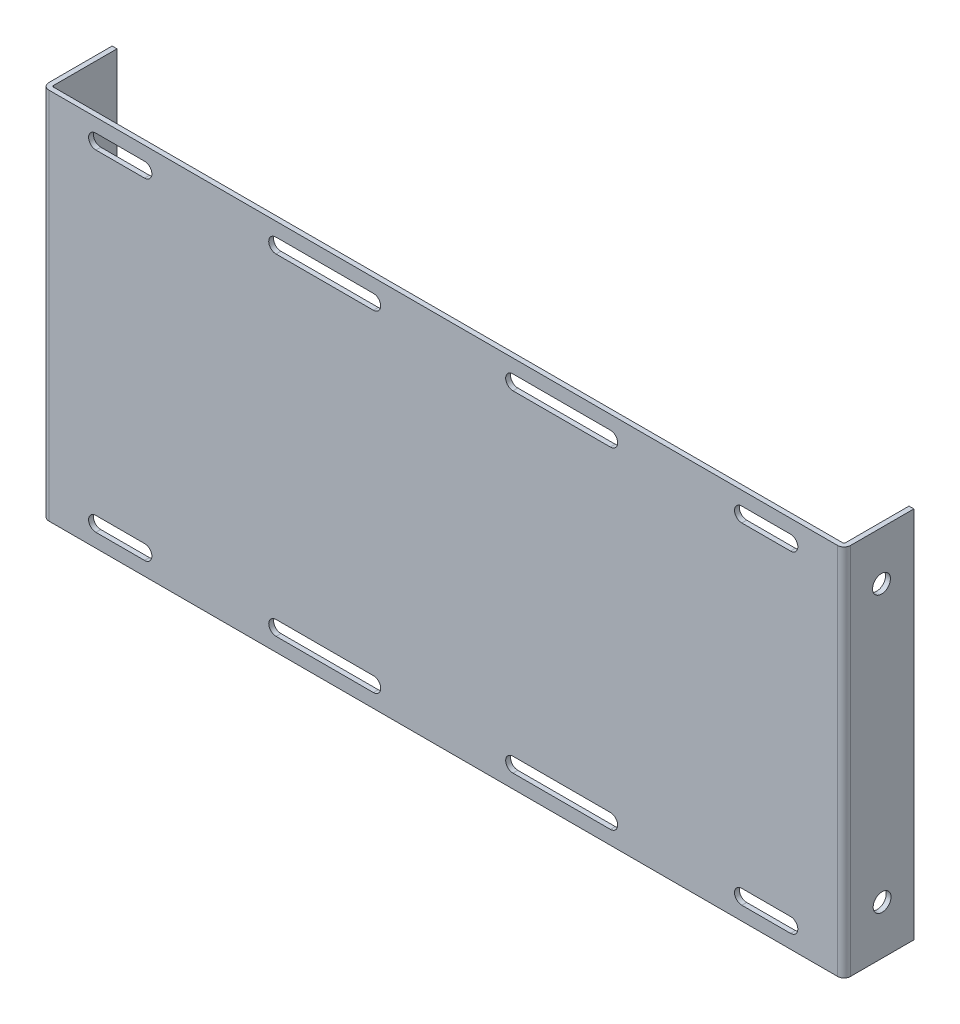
ISO-10303-21;
HEADER;
FILE_DESCRIPTION(('STEP AP214'),'2;1');
FILE_NAME('part.step','',(''),(''),'','','');
FILE_SCHEMA(('AUTOMOTIVE_DESIGN { 1 0 10303 214 1 1 1 1 }'));
ENDSEC;
DATA;
#1=APPLICATION_CONTEXT('core data for automotive mechanical design processes');
#2=APPLICATION_PROTOCOL_DEFINITION('international standard','automotive_design',2000,#1);
#3=PRODUCT_CONTEXT('',#1,'mechanical');
#4=PRODUCT('Part','Part','',(#3));
#5=PRODUCT_RELATED_PRODUCT_CATEGORY('part','',(#4));
#6=PRODUCT_DEFINITION_FORMATION('','',#4);
#7=PRODUCT_DEFINITION_CONTEXT('part definition',#1,'design');
#8=PRODUCT_DEFINITION('design','',#6,#7);
#9=PRODUCT_DEFINITION_SHAPE('','',#8);
#10=(LENGTH_UNIT() NAMED_UNIT(*) SI_UNIT(.MILLI.,.METRE.));
#11=(NAMED_UNIT(*) PLANE_ANGLE_UNIT() SI_UNIT($,.RADIAN.));
#12=(NAMED_UNIT(*) SI_UNIT($,.STERADIAN.) SOLID_ANGLE_UNIT());
#13=UNCERTAINTY_MEASURE_WITH_UNIT(LENGTH_MEASURE(1.E-05),#10,'distance_accuracy_value','');
#14=(GEOMETRIC_REPRESENTATION_CONTEXT(3) GLOBAL_UNCERTAINTY_ASSIGNED_CONTEXT((#13)) GLOBAL_UNIT_ASSIGNED_CONTEXT((#10,
#11,#12)) REPRESENTATION_CONTEXT('',''));
#15=CARTESIAN_POINT('',(0.,0.,0.));
#16=DIRECTION('',(0.,0.,1.));
#17=DIRECTION('',(1.,0.,0.));
#18=AXIS2_PLACEMENT_3D('',#15,#16,#17);
#19=CARTESIAN_POINT('',(0.,0.,-10.));
#20=DIRECTION('',(0.,0.,1.));
#21=DIRECTION('',(1.,0.,0.));
#22=AXIS2_PLACEMENT_3D('',#19,#20,#21);
#23=PLANE('',#22);
#24=DIRECTION('',(1.,0.,0.));
#25=VECTOR('',#24,1.);
#26=CARTESIAN_POINT('',(0.,13.5,-10.));
#27=LINE('',#26,#25);
#28=CARTESIAN_POINT('',(119.699638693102,13.5,-10.));
#29=VERTEX_POINT('',#28);
#30=CARTESIAN_POINT('',(-119.699638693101,13.5,-10.));
#31=VERTEX_POINT('',#30);
#32=EDGE_CURVE('E376',#29,#31,#27,.F.);
#33=ORIENTED_EDGE('',*,*,#32,.F.);
#34=DIRECTION('',(0.,1.,0.));
#35=VECTOR('',#34,1.);
#36=CARTESIAN_POINT('',(119.699638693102,-15.,-10.));
#37=LINE('',#36,#35);
#38=CARTESIAN_POINT('',(119.699638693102,-13.5,-10.));
#39=VERTEX_POINT('',#38);
#40=EDGE_CURVE('E604',#29,#39,#37,.F.);
#41=ORIENTED_EDGE('',*,*,#40,.T.);
#42=DIRECTION('',(-1.,0.,0.));
#43=VECTOR('',#42,1.);
#44=CARTESIAN_POINT('',(0.,-13.5,-10.));
#45=LINE('',#44,#43);
#46=CARTESIAN_POINT('',(-119.699638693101,-13.5,-10.));
#47=VERTEX_POINT('',#46);
#48=EDGE_CURVE('E402',#47,#39,#45,.F.);
#49=ORIENTED_EDGE('',*,*,#48,.F.);
#50=DIRECTION('',(0.,1.,0.));
#51=VECTOR('',#50,1.);
#52=CARTESIAN_POINT('',(-119.699638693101,-15.,-10.));
#53=LINE('',#52,#51);
#54=EDGE_CURVE('E610',#47,#31,#53,.T.);
#55=ORIENTED_EDGE('',*,*,#54,.T.);
#56=EDGE_LOOP('',(#33,#41,#49,#55));
#57=FACE_BOUND('',#56,.T.);
#58=ADVANCED_FACE('F17',(#57),#23,.F.);
#59=CARTESIAN_POINT('',(0.,-13.5,-8.5));
#60=DIRECTION('',(-1.,0.,0.));
#61=DIRECTION('',(0.,-1.,0.));
#62=AXIS2_PLACEMENT_3D('',#59,#60,#61);
#63=CYLINDRICAL_SURFACE('',#62,1.5);
#64=CARTESIAN_POINT('',(-119.699638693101,-13.5,-8.5));
#65=DIRECTION('',(-1.,0.,0.));
#66=DIRECTION('',(0.,-1.,0.));
#67=AXIS2_PLACEMENT_3D('',#64,#65,#66);
#68=CIRCLE('',#67,1.5);
#69=CARTESIAN_POINT('',(-119.699638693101,-15.,-8.5));
#70=VERTEX_POINT('',#69);
#71=EDGE_CURVE('E20',#70,#47,#68,.F.);
#72=ORIENTED_EDGE('',*,*,#71,.T.);
#73=ORIENTED_EDGE('',*,*,#48,.T.);
#74=CARTESIAN_POINT('',(119.699638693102,-13.5,-8.5));
#75=DIRECTION('',(-1.,0.,0.));
#76=DIRECTION('',(0.,-1.,0.));
#77=AXIS2_PLACEMENT_3D('',#74,#75,#76);
#78=CIRCLE('',#77,1.5);
#79=CARTESIAN_POINT('',(119.699638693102,-15.,-8.5));
#80=VERTEX_POINT('',#79);
#81=EDGE_CURVE('E602',#39,#80,#78,.T.);
#82=ORIENTED_EDGE('',*,*,#81,.T.);
#83=DIRECTION('',(-1.,0.,0.));
#84=VECTOR('',#83,1.);
#85=CARTESIAN_POINT('',(119.699638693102,-15.,-8.5));
#86=LINE('',#85,#84);
#87=EDGE_CURVE('E310',#80,#70,#86,.T.);
#88=ORIENTED_EDGE('',*,*,#87,.T.);
#89=EDGE_LOOP('',(#72,#73,#82,#88));
#90=FACE_BOUND('',#89,.T.);
#91=ADVANCED_FACE('F726',(#90),#63,.T.);
#92=CARTESIAN_POINT('',(122.,0.,4.23272528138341E-13));
#93=DIRECTION('',(1.,0.,0.));
#94=DIRECTION('',(0.,0.,-1.));
#95=AXIS2_PLACEMENT_3D('',#92,#93,#94);
#96=PLANE('',#95);
#97=DIRECTION('',(0.,0.,1.));
#98=VECTOR('',#97,1.);
#99=CARTESIAN_POINT('',(122.,57.5,-20.));
#100=LINE('',#99,#98);
#101=CARTESIAN_POINT('',(122.,57.5,-20.));
#102=VERTEX_POINT('',#101);
#103=CARTESIAN_POINT('',(122.,57.5,-0.500000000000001));
#104=VERTEX_POINT('',#103);
#105=EDGE_CURVE('E590',#102,#104,#100,.T.);
#106=ORIENTED_EDGE('',*,*,#105,.F.);
#107=DIRECTION('',(0.,1.,0.));
#108=VECTOR('',#107,1.);
#109=CARTESIAN_POINT('',(122.,-57.5,-20.));
#110=LINE('',#109,#108);
#111=CARTESIAN_POINT('',(122.,-57.5,-20.));
#112=VERTEX_POINT('',#111);
#113=EDGE_CURVE('E661',#112,#102,#110,.T.);
#114=ORIENTED_EDGE('',*,*,#113,.F.);
#115=DIRECTION('',(0.,0.,-1.));
#116=VECTOR('',#115,1.);
#117=CARTESIAN_POINT('',(122.,-57.5,0.));
#118=LINE('',#117,#116);
#119=CARTESIAN_POINT('',(122.,-57.5,-0.499999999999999));
#120=VERTEX_POINT('',#119);
#121=EDGE_CURVE('E665',#120,#112,#118,.T.);
#122=ORIENTED_EDGE('',*,*,#121,.F.);
#123=DIRECTION('',(0.,-1.,0.));
#124=VECTOR('',#123,1.);
#125=CARTESIAN_POINT('',(122.,-57.5,-0.5));
#126=LINE('',#125,#124);
#127=EDGE_CURVE('E384',#120,#104,#126,.F.);
#128=ORIENTED_EDGE('',*,*,#127,.T.);
#129=EDGE_LOOP('',(#106,#114,#122,#128));
#130=FACE_BOUND('',#129,.T.);
#131=CARTESIAN_POINT('',(122.,42.5000000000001,-10.0326086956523));
#132=DIRECTION('',(-1.,0.,0.));
#133=DIRECTION('',(0.,0.,1.));
#134=AXIS2_PLACEMENT_3D('',#131,#132,#133);
#135=CIRCLE('',#134,2.75);
#136=CARTESIAN_POINT('',(122.,42.5000000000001,-7.28260869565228));
#137=VERTEX_POINT('',#136);
#138=EDGE_CURVE('E587',#137,#137,#135,.F.);
#139=ORIENTED_EDGE('',*,*,#138,.T.);
#140=EDGE_LOOP('',(#139));
#141=FACE_BOUND('',#140,.T.);
#142=CARTESIAN_POINT('',(122.,-42.5,-10.2173913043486));
#143=DIRECTION('',(-1.,0.,0.));
#144=DIRECTION('',(0.,0.,1.));
#145=AXIS2_PLACEMENT_3D('',#142,#143,#144);
#146=CIRCLE('',#145,2.75);
#147=CARTESIAN_POINT('',(122.,-42.5,-7.46739130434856));
#148=VERTEX_POINT('',#147);
#149=EDGE_CURVE('E591',#148,#148,#146,.F.);
#150=ORIENTED_EDGE('',*,*,#149,.T.);
#151=EDGE_LOOP('',(#150));
#152=FACE_BOUND('',#151,.T.);
#153=ADVANCED_FACE('F929',(#130,#141,#152),#96,.F.);
#154=CARTESIAN_POINT('',(-122.,0.,4.23272528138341E-13));
#155=DIRECTION('',(1.,0.,0.));
#156=DIRECTION('',(0.,0.,-1.));
#157=AXIS2_PLACEMENT_3D('',#154,#155,#156);
#158=PLANE('',#157);
#159=DIRECTION('',(0.,0.,-1.));
#160=VECTOR('',#159,1.);
#161=CARTESIAN_POINT('',(-122.,-57.5,0.));
#162=LINE('',#161,#160);
#163=CARTESIAN_POINT('',(-122.,-57.4999999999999,-20.));
#164=VERTEX_POINT('',#163);
#165=CARTESIAN_POINT('',(-122.,-57.5,-0.500000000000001));
#166=VERTEX_POINT('',#165);
#167=EDGE_CURVE('E598',#164,#166,#162,.F.);
#168=ORIENTED_EDGE('',*,*,#167,.F.);
#169=DIRECTION('',(0.,1.,0.));
#170=VECTOR('',#169,1.);
#171=CARTESIAN_POINT('',(-122.,-57.4999999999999,-20.));
#172=LINE('',#171,#170);
#173=CARTESIAN_POINT('',(-122.,57.5000000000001,-20.));
#174=VERTEX_POINT('',#173);
#175=EDGE_CURVE('E672',#174,#164,#172,.F.);
#176=ORIENTED_EDGE('',*,*,#175,.F.);
#177=DIRECTION('',(0.,0.,1.));
#178=VECTOR('',#177,1.);
#179=CARTESIAN_POINT('',(-122.,57.5000000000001,-20.));
#180=LINE('',#179,#178);
#181=CARTESIAN_POINT('',(-122.,57.5,-0.499999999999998));
#182=VERTEX_POINT('',#181);
#183=EDGE_CURVE('E708',#182,#174,#180,.F.);
#184=ORIENTED_EDGE('',*,*,#183,.F.);
#185=DIRECTION('',(0.,1.,0.));
#186=VECTOR('',#185,1.);
#187=CARTESIAN_POINT('',(-122.,57.5,-0.5));
#188=LINE('',#187,#186);
#189=EDGE_CURVE('E638',#182,#166,#188,.F.);
#190=ORIENTED_EDGE('',*,*,#189,.T.);
#191=EDGE_LOOP('',(#168,#176,#184,#190));
#192=FACE_BOUND('',#191,.T.);
#193=CARTESIAN_POINT('',(-122.,42.5000000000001,-10.0326086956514));
#194=DIRECTION('',(-1.,0.,0.));
#195=DIRECTION('',(0.,0.,1.));
#196=AXIS2_PLACEMENT_3D('',#193,#194,#195);
#197=CIRCLE('',#196,2.75);
#198=CARTESIAN_POINT('',(-122.,42.5000000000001,-7.28260869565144));
#199=VERTEX_POINT('',#198);
#200=EDGE_CURVE('E595',#199,#199,#197,.T.);
#201=ORIENTED_EDGE('',*,*,#200,.T.);
#202=EDGE_LOOP('',(#201));
#203=FACE_BOUND('',#202,.T.);
#204=CARTESIAN_POINT('',(-122.,-42.5,-10.2173913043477));
#205=DIRECTION('',(-1.,0.,0.));
#206=DIRECTION('',(0.,0.,1.));
#207=AXIS2_PLACEMENT_3D('',#204,#205,#206);
#208=CIRCLE('',#207,2.75);
#209=CARTESIAN_POINT('',(-122.,-42.5,-7.46739130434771));
#210=VERTEX_POINT('',#209);
#211=EDGE_CURVE('E599',#210,#210,#208,.T.);
#212=ORIENTED_EDGE('',*,*,#211,.T.);
#213=EDGE_LOOP('',(#212));
#214=FACE_BOUND('',#213,.T.);
#215=ADVANCED_FACE('F1033',(#192,#203,#214),#158,.T.);
#216=CARTESIAN_POINT('',(0.,13.5,-8.5));
#217=DIRECTION('',(1.,0.,0.));
#218=DIRECTION('',(0.,0.,-1.));
#219=AXIS2_PLACEMENT_3D('',#216,#217,#218);
#220=CYLINDRICAL_SURFACE('',#219,1.5);
#221=CARTESIAN_POINT('',(119.699638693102,13.5,-8.5));
#222=DIRECTION('',(1.,0.,0.));
#223=DIRECTION('',(0.,0.,-1.));
#224=AXIS2_PLACEMENT_3D('',#221,#222,#223);
#225=CIRCLE('',#224,1.5);
#226=CARTESIAN_POINT('',(119.699638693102,15.,-8.5));
#227=VERTEX_POINT('',#226);
#228=EDGE_CURVE('E605',#227,#29,#225,.F.);
#229=ORIENTED_EDGE('',*,*,#228,.T.);
#230=ORIENTED_EDGE('',*,*,#32,.T.);
#231=CARTESIAN_POINT('',(-119.699638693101,13.5,-8.5));
#232=DIRECTION('',(1.,0.,0.));
#233=DIRECTION('',(0.,0.,-1.));
#234=AXIS2_PLACEMENT_3D('',#231,#232,#233);
#235=CIRCLE('',#234,1.5);
#236=CARTESIAN_POINT('',(-119.699638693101,15.,-8.5));
#237=VERTEX_POINT('',#236);
#238=EDGE_CURVE('E608',#31,#237,#235,.T.);
#239=ORIENTED_EDGE('',*,*,#238,.T.);
#240=DIRECTION('',(1.,0.,0.));
#241=VECTOR('',#240,1.);
#242=CARTESIAN_POINT('',(119.699638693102,15.,-8.5));
#243=LINE('',#242,#241);
#244=EDGE_CURVE('E623',#237,#227,#243,.T.);
#245=ORIENTED_EDGE('',*,*,#244,.T.);
#246=EDGE_LOOP('',(#229,#230,#239,#245));
#247=FACE_BOUND('',#246,.T.);
#248=ADVANCED_FACE('F1037',(#247),#220,.T.);
#249=CARTESIAN_POINT('',(-119.699638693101,-15.,-10.));
#250=DIRECTION('',(1.,0.,0.));
#251=DIRECTION('',(0.,0.,-1.));
#252=AXIS2_PLACEMENT_3D('',#249,#250,#251);
#253=PLANE('',#252);
#254=DIRECTION('',(0.,0.,-1.));
#255=VECTOR('',#254,1.);
#256=CARTESIAN_POINT('',(-119.699638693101,13.5,-10.));
#257=LINE('',#256,#255);
#258=CARTESIAN_POINT('',(-119.699638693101,13.5,0.));
#259=VERTEX_POINT('',#258);
#260=CARTESIAN_POINT('',(-119.699638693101,13.5,-8.5));
#261=VERTEX_POINT('',#260);
#262=EDGE_CURVE('E421',#259,#261,#257,.T.);
#263=ORIENTED_EDGE('',*,*,#262,.F.);
#264=DIRECTION('',(0.,1.,0.));
#265=VECTOR('',#264,1.);
#266=CARTESIAN_POINT('',(-119.699638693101,-15.,0.));
#267=LINE('',#266,#265);
#268=CARTESIAN_POINT('',(-119.699638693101,15.,0.));
#269=VERTEX_POINT('',#268);
#270=EDGE_CURVE('E609',#269,#259,#267,.F.);
#271=ORIENTED_EDGE('',*,*,#270,.F.);
#272=DIRECTION('',(0.,0.,-1.));
#273=VECTOR('',#272,1.);
#274=CARTESIAN_POINT('',(-119.699638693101,15.,-10.));
#275=LINE('',#274,#273);
#276=EDGE_CURVE('E625',#269,#237,#275,.T.);
#277=ORIENTED_EDGE('',*,*,#276,.T.);
#278=ORIENTED_EDGE('',*,*,#238,.F.);
#279=ORIENTED_EDGE('',*,*,#54,.F.);
#280=ORIENTED_EDGE('',*,*,#71,.F.);
#281=DIRECTION('',(0.,0.,1.));
#282=VECTOR('',#281,1.);
#283=CARTESIAN_POINT('',(-119.699638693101,-15.,-10.));
#284=LINE('',#283,#282);
#285=CARTESIAN_POINT('',(-119.699638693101,-15.,0.));
#286=VERTEX_POINT('',#285);
#287=EDGE_CURVE('E374',#70,#286,#284,.T.);
#288=ORIENTED_EDGE('',*,*,#287,.T.);
#289=DIRECTION('',(0.,1.,0.));
#290=VECTOR('',#289,1.);
#291=CARTESIAN_POINT('',(-119.699638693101,-15.,0.));
#292=LINE('',#291,#290);
#293=CARTESIAN_POINT('',(-119.699638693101,-13.5,0.));
#294=VERTEX_POINT('',#293);
#295=EDGE_CURVE('E363',#294,#286,#292,.F.);
#296=ORIENTED_EDGE('',*,*,#295,.F.);
#297=DIRECTION('',(0.,0.,1.));
#298=VECTOR('',#297,1.);
#299=CARTESIAN_POINT('',(-119.699638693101,-13.5,-10.));
#300=LINE('',#299,#298);
#301=CARTESIAN_POINT('',(-119.699638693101,-13.5,-8.5));
#302=VERTEX_POINT('',#301);
#303=EDGE_CURVE('E371',#302,#294,#300,.T.);
#304=ORIENTED_EDGE('',*,*,#303,.F.);
#305=DIRECTION('',(0.,1.,0.));
#306=VECTOR('',#305,1.);
#307=CARTESIAN_POINT('',(-119.699638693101,0.,-8.5));
#308=LINE('',#307,#306);
#309=EDGE_CURVE('E614',#261,#302,#308,.F.);
#310=ORIENTED_EDGE('',*,*,#309,.F.);
#311=EDGE_LOOP('',(#263,#271,#277,#278,#279,#280,#288,#296,#304,#310));
#312=FACE_BOUND('',#311,.T.);
#313=ADVANCED_FACE('F369',(#312),#253,.F.);
#314=CARTESIAN_POINT('',(0.,0.,-8.5));
#315=DIRECTION('',(0.,0.,1.));
#316=DIRECTION('',(1.,0.,0.));
#317=AXIS2_PLACEMENT_3D('',#314,#315,#316);
#318=PLANE('',#317);
#319=DIRECTION('',(0.,1.,0.));
#320=VECTOR('',#319,1.);
#321=CARTESIAN_POINT('',(119.699638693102,-15.,-8.5));
#322=LINE('',#321,#320);
#323=CARTESIAN_POINT('',(119.699638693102,-13.5,-8.5));
#324=VERTEX_POINT('',#323);
#325=CARTESIAN_POINT('',(119.699638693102,13.5,-8.5));
#326=VERTEX_POINT('',#325);
#327=EDGE_CURVE('E318',#324,#326,#322,.T.);
#328=ORIENTED_EDGE('',*,*,#327,.T.);
#329=DIRECTION('',(1.,0.,0.));
#330=VECTOR('',#329,1.);
#331=CARTESIAN_POINT('',(119.699638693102,13.5,-8.5));
#332=LINE('',#331,#330);
#333=EDGE_CURVE('E411',#261,#326,#332,.T.);
#334=ORIENTED_EDGE('',*,*,#333,.F.);
#335=ORIENTED_EDGE('',*,*,#309,.T.);
#336=DIRECTION('',(-1.,0.,0.));
#337=VECTOR('',#336,1.);
#338=CARTESIAN_POINT('',(119.699638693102,-13.5,-8.5));
#339=LINE('',#338,#337);
#340=EDGE_CURVE('E383',#324,#302,#339,.T.);
#341=ORIENTED_EDGE('',*,*,#340,.F.);
#342=EDGE_LOOP('',(#328,#334,#335,#341));
#343=FACE_BOUND('',#342,.T.);
#344=ADVANCED_FACE('F1056',(#343),#318,.T.);
#345=CARTESIAN_POINT('',(119.699638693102,-15.,-10.));
#346=DIRECTION('',(-1.,0.,0.));
#347=DIRECTION('',(0.,0.,1.));
#348=AXIS2_PLACEMENT_3D('',#345,#346,#347);
#349=PLANE('',#348);
#350=DIRECTION('',(0.,0.,1.));
#351=VECTOR('',#350,1.);
#352=CARTESIAN_POINT('',(119.699638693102,-13.5,-10.));
#353=LINE('',#352,#351);
#354=CARTESIAN_POINT('',(119.699638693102,-13.5,0.));
#355=VERTEX_POINT('',#354);
#356=EDGE_CURVE('E646',#355,#324,#353,.F.);
#357=ORIENTED_EDGE('',*,*,#356,.F.);
#358=DIRECTION('',(0.,1.,0.));
#359=VECTOR('',#358,1.);
#360=CARTESIAN_POINT('',(119.699638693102,-15.,0.));
#361=LINE('',#360,#359);
#362=CARTESIAN_POINT('',(119.699638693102,-15.,0.));
#363=VERTEX_POINT('',#362);
#364=EDGE_CURVE('E388',#363,#355,#361,.T.);
#365=ORIENTED_EDGE('',*,*,#364,.F.);
#366=DIRECTION('',(0.,0.,1.));
#367=VECTOR('',#366,1.);
#368=CARTESIAN_POINT('',(119.699638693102,-15.,-10.));
#369=LINE('',#368,#367);
#370=EDGE_CURVE('E644',#363,#80,#369,.F.);
#371=ORIENTED_EDGE('',*,*,#370,.T.);
#372=ORIENTED_EDGE('',*,*,#81,.F.);
#373=ORIENTED_EDGE('',*,*,#40,.F.);
#374=ORIENTED_EDGE('',*,*,#228,.F.);
#375=DIRECTION('',(0.,0.,-1.));
#376=VECTOR('',#375,1.);
#377=CARTESIAN_POINT('',(119.699638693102,15.,-10.));
#378=LINE('',#377,#376);
#379=CARTESIAN_POINT('',(119.699638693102,15.,0.));
#380=VERTEX_POINT('',#379);
#381=EDGE_CURVE('E424',#227,#380,#378,.F.);
#382=ORIENTED_EDGE('',*,*,#381,.T.);
#383=DIRECTION('',(0.,1.,0.));
#384=VECTOR('',#383,1.);
#385=CARTESIAN_POINT('',(119.699638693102,-15.,0.));
#386=LINE('',#385,#384);
#387=CARTESIAN_POINT('',(119.699638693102,13.5,0.));
#388=VERTEX_POINT('',#387);
#389=EDGE_CURVE('E607',#388,#380,#386,.T.);
#390=ORIENTED_EDGE('',*,*,#389,.F.);
#391=DIRECTION('',(0.,0.,-1.));
#392=VECTOR('',#391,1.);
#393=CARTESIAN_POINT('',(119.699638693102,13.5,-10.));
#394=LINE('',#393,#392);
#395=EDGE_CURVE('E407',#326,#388,#394,.F.);
#396=ORIENTED_EDGE('',*,*,#395,.F.);
#397=ORIENTED_EDGE('',*,*,#327,.F.);
#398=EDGE_LOOP('',(#357,#365,#371,#372,#373,#374,#382,#390,#396,#397));
#399=FACE_BOUND('',#398,.T.);
#400=ADVANCED_FACE('F727',(#399),#349,.F.);
#401=CARTESIAN_POINT('',(123.5,-42.5,-10.2173913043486));
#402=DIRECTION('',(-1.,0.,0.));
#403=DIRECTION('',(0.,0.,1.));
#404=AXIS2_PLACEMENT_3D('',#401,#402,#403);
#405=CYLINDRICAL_SURFACE('',#404,2.75);
#406=ORIENTED_EDGE('',*,*,#211,.F.);
#407=EDGE_LOOP('',(#406));
#408=FACE_BOUND('',#407,.T.);
#409=CARTESIAN_POINT('',(-123.5,-42.5,-10.2173913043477));
#410=DIRECTION('',(-1.,0.,0.));
#411=DIRECTION('',(0.,0.,1.));
#412=AXIS2_PLACEMENT_3D('',#409,#410,#411);
#413=CIRCLE('',#412,2.75);
#414=CARTESIAN_POINT('',(-123.5,-42.5,-7.46739130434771));
#415=VERTEX_POINT('',#414);
#416=EDGE_CURVE('E583',#415,#415,#413,.T.);
#417=ORIENTED_EDGE('',*,*,#416,.T.);
#418=EDGE_LOOP('',(#417));
#419=FACE_BOUND('',#418,.T.);
#420=ADVANCED_FACE('F1043',(#408,#419),#405,.F.);
#421=CARTESIAN_POINT('',(123.5,42.5000000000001,-10.0326086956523));
#422=DIRECTION('',(-1.,0.,0.));
#423=DIRECTION('',(0.,0.,1.));
#424=AXIS2_PLACEMENT_3D('',#421,#422,#423);
#425=CYLINDRICAL_SURFACE('',#424,2.75);
#426=ORIENTED_EDGE('',*,*,#200,.F.);
#427=EDGE_LOOP('',(#426));
#428=FACE_BOUND('',#427,.T.);
#429=CARTESIAN_POINT('',(-123.5,42.5000000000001,-10.0326086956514));
#430=DIRECTION('',(-1.,0.,0.));
#431=DIRECTION('',(0.,0.,1.));
#432=AXIS2_PLACEMENT_3D('',#429,#430,#431);
#433=CIRCLE('',#432,2.75);
#434=CARTESIAN_POINT('',(-123.5,42.5000000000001,-7.28260869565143));
#435=VERTEX_POINT('',#434);
#436=EDGE_CURVE('E579',#435,#435,#433,.T.);
#437=ORIENTED_EDGE('',*,*,#436,.T.);
#438=EDGE_LOOP('',(#437));
#439=FACE_BOUND('',#438,.T.);
#440=ADVANCED_FACE('F1046',(#428,#439),#425,.F.);
#441=CARTESIAN_POINT('',(-123.5,-57.4999999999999,-20.));
#442=DIRECTION('',(0.,0.,-1.));
#443=DIRECTION('',(-1.,0.,0.));
#444=AXIS2_PLACEMENT_3D('',#441,#442,#443);
#445=PLANE('',#444);
#446=DIRECTION('',(0.,1.,0.));
#447=VECTOR('',#446,1.);
#448=CARTESIAN_POINT('',(-123.5,0.,-20.));
#449=LINE('',#448,#447);
#450=CARTESIAN_POINT('',(-123.5,-57.5,-20.));
#451=VERTEX_POINT('',#450);
#452=CARTESIAN_POINT('',(-123.5,57.5000000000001,-20.));
#453=VERTEX_POINT('',#452);
#454=EDGE_CURVE('E711',#451,#453,#449,.T.);
#455=ORIENTED_EDGE('',*,*,#454,.T.);
#456=DIRECTION('',(1.,0.,0.));
#457=VECTOR('',#456,1.);
#458=CARTESIAN_POINT('',(-123.5,57.5000000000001,-20.));
#459=LINE('',#458,#457);
#460=EDGE_CURVE('E594',#174,#453,#459,.F.);
#461=ORIENTED_EDGE('',*,*,#460,.F.);
#462=ORIENTED_EDGE('',*,*,#175,.T.);
#463=DIRECTION('',(-1.,0.,0.));
#464=VECTOR('',#463,1.);
#465=CARTESIAN_POINT('',(-123.5,-57.4999999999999,-20.));
#466=LINE('',#465,#464);
#467=EDGE_CURVE('E675',#164,#451,#466,.T.);
#468=ORIENTED_EDGE('',*,*,#467,.T.);
#469=EDGE_LOOP('',(#455,#461,#462,#468));
#470=FACE_BOUND('',#469,.T.);
#471=ADVANCED_FACE('F1031',(#470),#445,.T.);
#472=CARTESIAN_POINT('',(123.5,-42.5,-10.2173913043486));
#473=DIRECTION('',(-1.,0.,0.));
#474=DIRECTION('',(0.,0.,1.));
#475=AXIS2_PLACEMENT_3D('',#472,#473,#474);
#476=CYLINDRICAL_SURFACE('',#475,2.75);
#477=ORIENTED_EDGE('',*,*,#149,.F.);
#478=EDGE_LOOP('',(#477));
#479=FACE_BOUND('',#478,.T.);
#480=CARTESIAN_POINT('',(123.5,-42.5,-10.2173913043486));
#481=DIRECTION('',(-1.,0.,0.));
#482=DIRECTION('',(0.,0.,1.));
#483=AXIS2_PLACEMENT_3D('',#480,#481,#482);
#484=CIRCLE('',#483,2.75);
#485=CARTESIAN_POINT('',(123.5,-42.5,-7.46739130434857));
#486=VERTEX_POINT('',#485);
#487=EDGE_CURVE('E570',#486,#486,#484,.T.);
#488=ORIENTED_EDGE('',*,*,#487,.F.);
#489=EDGE_LOOP('',(#488));
#490=FACE_BOUND('',#489,.T.);
#491=ADVANCED_FACE('F1138',(#479,#490),#476,.F.);
#492=CARTESIAN_POINT('',(123.5,42.5000000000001,-10.0326086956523));
#493=DIRECTION('',(-1.,0.,0.));
#494=DIRECTION('',(0.,0.,1.));
#495=AXIS2_PLACEMENT_3D('',#492,#493,#494);
#496=CYLINDRICAL_SURFACE('',#495,2.75);
#497=ORIENTED_EDGE('',*,*,#138,.F.);
#498=EDGE_LOOP('',(#497));
#499=FACE_BOUND('',#498,.T.);
#500=CARTESIAN_POINT('',(123.5,42.5000000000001,-10.0326086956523));
#501=DIRECTION('',(-1.,0.,0.));
#502=DIRECTION('',(0.,0.,1.));
#503=AXIS2_PLACEMENT_3D('',#500,#501,#502);
#504=CIRCLE('',#503,2.75);
#505=CARTESIAN_POINT('',(123.5,42.5000000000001,-7.28260869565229));
#506=VERTEX_POINT('',#505);
#507=EDGE_CURVE('E566',#506,#506,#504,.T.);
#508=ORIENTED_EDGE('',*,*,#507,.F.);
#509=EDGE_LOOP('',(#508));
#510=FACE_BOUND('',#509,.T.);
#511=ADVANCED_FACE('F741',(#499,#510),#496,.F.);
#512=CARTESIAN_POINT('',(123.5,-57.5,-20.));
#513=DIRECTION('',(0.,0.,-1.));
#514=DIRECTION('',(-1.,0.,0.));
#515=AXIS2_PLACEMENT_3D('',#512,#513,#514);
#516=PLANE('',#515);
#517=DIRECTION('',(0.,1.,0.));
#518=VECTOR('',#517,1.);
#519=CARTESIAN_POINT('',(123.5,0.,-20.));
#520=LINE('',#519,#518);
#521=CARTESIAN_POINT('',(123.5,-57.5,-20.));
#522=VERTEX_POINT('',#521);
#523=CARTESIAN_POINT('',(123.5,57.5,-20.));
#524=VERTEX_POINT('',#523);
#525=EDGE_CURVE('E565',#522,#524,#520,.T.);
#526=ORIENTED_EDGE('',*,*,#525,.F.);
#527=DIRECTION('',(-1.,0.,0.));
#528=VECTOR('',#527,1.);
#529=CARTESIAN_POINT('',(123.5,-57.5,-20.));
#530=LINE('',#529,#528);
#531=EDGE_CURVE('E655',#522,#112,#530,.T.);
#532=ORIENTED_EDGE('',*,*,#531,.T.);
#533=ORIENTED_EDGE('',*,*,#113,.T.);
#534=DIRECTION('',(-1.,0.,0.));
#535=VECTOR('',#534,1.);
#536=CARTESIAN_POINT('',(123.5,57.5,-20.));
#537=LINE('',#536,#535);
#538=EDGE_CURVE('E664',#102,#524,#537,.F.);
#539=ORIENTED_EDGE('',*,*,#538,.T.);
#540=EDGE_LOOP('',(#526,#532,#533,#539));
#541=FACE_BOUND('',#540,.T.);
#542=ADVANCED_FACE('F732',(#541),#516,.T.);
#543=CARTESIAN_POINT('',(119.699638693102,-15.,-10.));
#544=DIRECTION('',(0.,1.,0.));
#545=DIRECTION('',(-1.,0.,0.));
#546=AXIS2_PLACEMENT_3D('',#543,#544,#545);
#547=PLANE('',#546);
#548=ORIENTED_EDGE('',*,*,#87,.F.);
#549=ORIENTED_EDGE('',*,*,#370,.F.);
#550=DIRECTION('',(1.,0.,0.));
#551=VECTOR('',#550,1.);
#552=CARTESIAN_POINT('',(0.,-15.,0.));
#553=LINE('',#552,#551);
#554=EDGE_CURVE('E390',#363,#286,#553,.F.);
#555=ORIENTED_EDGE('',*,*,#554,.T.);
#556=ORIENTED_EDGE('',*,*,#287,.F.);
#557=EDGE_LOOP('',(#548,#549,#555,#556));
#558=FACE_BOUND('',#557,.T.);
#559=ADVANCED_FACE('F730',(#558),#547,.F.);
#560=CARTESIAN_POINT('',(119.699638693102,-13.5,-10.));
#561=DIRECTION('',(0.,1.,0.));
#562=DIRECTION('',(-1.,0.,0.));
#563=AXIS2_PLACEMENT_3D('',#560,#561,#562);
#564=PLANE('',#563);
#565=ORIENTED_EDGE('',*,*,#340,.T.);
#566=ORIENTED_EDGE('',*,*,#303,.T.);
#567=DIRECTION('',(1.,0.,0.));
#568=VECTOR('',#567,1.);
#569=CARTESIAN_POINT('',(0.,-13.5,0.));
#570=LINE('',#569,#568);
#571=EDGE_CURVE('E382',#294,#355,#570,.T.);
#572=ORIENTED_EDGE('',*,*,#571,.T.);
#573=ORIENTED_EDGE('',*,*,#356,.T.);
#574=EDGE_LOOP('',(#565,#566,#572,#573));
#575=FACE_BOUND('',#574,.T.);
#576=ADVANCED_FACE('F380',(#575),#564,.T.);
#577=CARTESIAN_POINT('',(121.5,-57.5,-0.500000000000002));
#578=DIRECTION('',(0.,-1.,0.));
#579=DIRECTION('',(0.,0.,-1.));
#580=AXIS2_PLACEMENT_3D('',#577,#578,#579);
#581=CYLINDRICAL_SURFACE('',#580,0.5);
#582=CARTESIAN_POINT('',(121.5,57.5,-0.500000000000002));
#583=DIRECTION('',(0.,-1.,0.));
#584=DIRECTION('',(0.,0.,-1.));
#585=AXIS2_PLACEMENT_3D('',#582,#583,#584);
#586=CIRCLE('',#585,0.5);
#587=CARTESIAN_POINT('',(121.5,57.5,0.));
#588=VERTEX_POINT('',#587);
#589=EDGE_CURVE('E394',#104,#588,#586,.T.);
#590=ORIENTED_EDGE('',*,*,#589,.F.);
#591=ORIENTED_EDGE('',*,*,#127,.F.);
#592=CARTESIAN_POINT('',(121.5,-57.5,-0.500000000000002));
#593=DIRECTION('',(0.,-1.,0.));
#594=DIRECTION('',(0.,0.,-1.));
#595=AXIS2_PLACEMENT_3D('',#592,#593,#594);
#596=CIRCLE('',#595,0.5);
#597=CARTESIAN_POINT('',(121.5,-57.5,0.));
#598=VERTEX_POINT('',#597);
#599=EDGE_CURVE('E573',#120,#598,#596,.T.);
#600=ORIENTED_EDGE('',*,*,#599,.T.);
#601=DIRECTION('',(0.,1.,0.));
#602=VECTOR('',#601,1.);
#603=CARTESIAN_POINT('',(121.5,0.,0.));
#604=LINE('',#603,#602);
#605=EDGE_CURVE('E389',#598,#588,#604,.T.);
#606=ORIENTED_EDGE('',*,*,#605,.T.);
#607=EDGE_LOOP('',(#590,#591,#600,#606));
#608=FACE_BOUND('',#607,.T.);
#609=ADVANCED_FACE('F739',(#608),#581,.F.);
#610=CARTESIAN_POINT('',(-121.5,57.5,-0.500000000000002));
#611=DIRECTION('',(0.,1.,0.));
#612=DIRECTION('',(0.,0.,1.));
#613=AXIS2_PLACEMENT_3D('',#610,#611,#612);
#614=CYLINDRICAL_SURFACE('',#613,0.5);
#615=CARTESIAN_POINT('',(-121.5,-57.5,-0.500000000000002));
#616=DIRECTION('',(0.,1.,0.));
#617=DIRECTION('',(0.,0.,1.));
#618=AXIS2_PLACEMENT_3D('',#615,#616,#617);
#619=CIRCLE('',#618,0.5);
#620=CARTESIAN_POINT('',(-121.5,-57.5,0.));
#621=VERTEX_POINT('',#620);
#622=EDGE_CURVE('E575',#166,#621,#619,.T.);
#623=ORIENTED_EDGE('',*,*,#622,.F.);
#624=ORIENTED_EDGE('',*,*,#189,.F.);
#625=CARTESIAN_POINT('',(-121.5,57.5,-0.500000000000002));
#626=DIRECTION('',(0.,1.,0.));
#627=DIRECTION('',(0.,0.,1.));
#628=AXIS2_PLACEMENT_3D('',#625,#626,#627);
#629=CIRCLE('',#628,0.5);
#630=CARTESIAN_POINT('',(-121.5,57.5,0.));
#631=VERTEX_POINT('',#630);
#632=EDGE_CURVE('E410',#182,#631,#629,.T.);
#633=ORIENTED_EDGE('',*,*,#632,.T.);
#634=DIRECTION('',(0.,1.,0.));
#635=VECTOR('',#634,1.);
#636=CARTESIAN_POINT('',(-121.5,0.,0.));
#637=LINE('',#636,#635);
#638=EDGE_CURVE('E392',#631,#621,#637,.F.);
#639=ORIENTED_EDGE('',*,*,#638,.T.);
#640=EDGE_LOOP('',(#623,#624,#633,#639));
#641=FACE_BOUND('',#640,.T.);
#642=ADVANCED_FACE('F914',(#641),#614,.F.);
#643=CARTESIAN_POINT('',(119.699638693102,15.,-10.));
#644=DIRECTION('',(0.,-1.,0.));
#645=DIRECTION('',(0.,0.,-1.));
#646=AXIS2_PLACEMENT_3D('',#643,#644,#645);
#647=PLANE('',#646);
#648=ORIENTED_EDGE('',*,*,#244,.F.);
#649=ORIENTED_EDGE('',*,*,#276,.F.);
#650=DIRECTION('',(1.,0.,0.));
#651=VECTOR('',#650,1.);
#652=CARTESIAN_POINT('',(0.,15.,0.));
#653=LINE('',#652,#651);
#654=EDGE_CURVE('E418',#269,#380,#653,.T.);
#655=ORIENTED_EDGE('',*,*,#654,.T.);
#656=ORIENTED_EDGE('',*,*,#381,.F.);
#657=EDGE_LOOP('',(#648,#649,#655,#656));
#658=FACE_BOUND('',#657,.T.);
#659=ADVANCED_FACE('F910',(#658),#647,.F.);
#660=CARTESIAN_POINT('',(119.699638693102,13.5,-10.));
#661=DIRECTION('',(0.,-1.,0.));
#662=DIRECTION('',(0.,0.,-1.));
#663=AXIS2_PLACEMENT_3D('',#660,#661,#662);
#664=PLANE('',#663);
#665=ORIENTED_EDGE('',*,*,#333,.T.);
#666=ORIENTED_EDGE('',*,*,#395,.T.);
#667=DIRECTION('',(1.,0.,0.));
#668=VECTOR('',#667,1.);
#669=CARTESIAN_POINT('',(0.,13.5,0.));
#670=LINE('',#669,#668);
#671=EDGE_CURVE('E414',#388,#259,#670,.F.);
#672=ORIENTED_EDGE('',*,*,#671,.T.);
#673=ORIENTED_EDGE('',*,*,#262,.T.);
#674=EDGE_LOOP('',(#665,#666,#672,#673));
#675=FACE_BOUND('',#674,.T.);
#676=ADVANCED_FACE('F906',(#675),#664,.T.);
#677=CARTESIAN_POINT('',(-123.5,0.,4.28509750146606E-13));
#678=DIRECTION('',(1.,0.,0.));
#679=DIRECTION('',(0.,0.,-1.));
#680=AXIS2_PLACEMENT_3D('',#677,#678,#679);
#681=PLANE('',#680);
#682=DIRECTION('',(0.,0.,-1.));
#683=VECTOR('',#682,1.);
#684=CARTESIAN_POINT('',(-123.5,57.5000000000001,4.28509750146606E-13));
#685=LINE('',#684,#683);
#686=CARTESIAN_POINT('',(-123.5,57.5,-0.499999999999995));
#687=VERTEX_POINT('',#686);
#688=EDGE_CURVE('E578',#453,#687,#685,.F.);
#689=ORIENTED_EDGE('',*,*,#688,.F.);
#690=ORIENTED_EDGE('',*,*,#454,.F.);
#691=DIRECTION('',(0.,0.,-1.));
#692=VECTOR('',#691,1.);
#693=CARTESIAN_POINT('',(-123.5,-57.5,4.28509750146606E-13));
#694=LINE('',#693,#692);
#695=CARTESIAN_POINT('',(-123.5,-57.5,-0.499999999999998));
#696=VERTEX_POINT('',#695);
#697=EDGE_CURVE('E582',#696,#451,#694,.T.);
#698=ORIENTED_EDGE('',*,*,#697,.F.);
#699=DIRECTION('',(0.,1.,0.));
#700=VECTOR('',#699,1.);
#701=CARTESIAN_POINT('',(-123.5,57.5,-0.499999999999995));
#702=LINE('',#701,#700);
#703=EDGE_CURVE('E511',#687,#696,#702,.F.);
#704=ORIENTED_EDGE('',*,*,#703,.F.);
#705=EDGE_LOOP('',(#689,#690,#698,#704));
#706=FACE_BOUND('',#705,.T.);
#707=ORIENTED_EDGE('',*,*,#436,.F.);
#708=EDGE_LOOP('',(#707));
#709=FACE_BOUND('',#708,.T.);
#710=ORIENTED_EDGE('',*,*,#416,.F.);
#711=EDGE_LOOP('',(#710));
#712=FACE_BOUND('',#711,.T.);
#713=ADVANCED_FACE('F902',(#706,#709,#712),#681,.F.);
#714=CARTESIAN_POINT('',(123.5,0.,4.28509750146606E-13));
#715=DIRECTION('',(1.,0.,0.));
#716=DIRECTION('',(0.,0.,-1.));
#717=AXIS2_PLACEMENT_3D('',#714,#715,#716);
#718=PLANE('',#717);
#719=DIRECTION('',(0.,0.,-1.));
#720=VECTOR('',#719,1.);
#721=CARTESIAN_POINT('',(123.5,-57.5,4.28509750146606E-13));
#722=LINE('',#721,#720);
#723=CARTESIAN_POINT('',(123.5,-57.5,-0.499999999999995));
#724=VERTEX_POINT('',#723);
#725=EDGE_CURVE('E689',#724,#522,#722,.T.);
#726=ORIENTED_EDGE('',*,*,#725,.T.);
#727=ORIENTED_EDGE('',*,*,#525,.T.);
#728=DIRECTION('',(0.,0.,-1.));
#729=VECTOR('',#728,1.);
#730=CARTESIAN_POINT('',(123.5,57.5,4.28509750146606E-13));
#731=LINE('',#730,#729);
#732=CARTESIAN_POINT('',(123.5,57.5,-0.499999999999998));
#733=VERTEX_POINT('',#732);
#734=EDGE_CURVE('E569',#524,#733,#731,.F.);
#735=ORIENTED_EDGE('',*,*,#734,.T.);
#736=DIRECTION('',(0.,-1.,0.));
#737=VECTOR('',#736,1.);
#738=CARTESIAN_POINT('',(123.5,-57.5,-0.499999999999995));
#739=LINE('',#738,#737);
#740=EDGE_CURVE('E504',#724,#733,#739,.F.);
#741=ORIENTED_EDGE('',*,*,#740,.F.);
#742=EDGE_LOOP('',(#726,#727,#735,#741));
#743=FACE_BOUND('',#742,.T.);
#744=ORIENTED_EDGE('',*,*,#507,.T.);
#745=EDGE_LOOP('',(#744));
#746=FACE_BOUND('',#745,.T.);
#747=ORIENTED_EDGE('',*,*,#487,.T.);
#748=EDGE_LOOP('',(#747));
#749=FACE_BOUND('',#748,.T.);
#750=ADVANCED_FACE('F898',(#743,#746,#749),#718,.T.);
#751=CARTESIAN_POINT('',(0.,0.,0.));
#752=DIRECTION('',(0.,0.,1.));
#753=DIRECTION('',(1.,0.,0.));
#754=AXIS2_PLACEMENT_3D('',#751,#752,#753);
#755=PLANE('',#754);
#756=DIRECTION('',(1.,0.,0.));
#757=VECTOR('',#756,1.);
#758=CARTESIAN_POINT('',(107.,-48.75,0.));
#759=LINE('',#758,#757);
#760=CARTESIAN_POINT('',(92.0000000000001,-48.75,0.));
#761=VERTEX_POINT('',#760);
#762=CARTESIAN_POINT('',(107.,-48.75,0.));
#763=VERTEX_POINT('',#762);
#764=EDGE_CURVE('E493',#761,#763,#759,.T.);
#765=ORIENTED_EDGE('',*,*,#764,.F.);
#766=CARTESIAN_POINT('',(92.0000000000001,-51.,0.));
#767=DIRECTION('',(0.,0.,1.));
#768=DIRECTION('',(1.,0.,0.));
#769=AXIS2_PLACEMENT_3D('',#766,#767,#768);
#770=CIRCLE('',#769,2.25);
#771=CARTESIAN_POINT('',(92.0000000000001,-53.25,0.));
#772=VERTEX_POINT('',#771);
#773=EDGE_CURVE('E483',#761,#772,#770,.T.);
#774=ORIENTED_EDGE('',*,*,#773,.T.);
#775=DIRECTION('',(1.,0.,0.));
#776=VECTOR('',#775,1.);
#777=CARTESIAN_POINT('',(107.,-53.25,0.));
#778=LINE('',#777,#776);
#779=CARTESIAN_POINT('',(107.,-53.25,0.));
#780=VERTEX_POINT('',#779);
#781=EDGE_CURVE('E489',#780,#772,#778,.F.);
#782=ORIENTED_EDGE('',*,*,#781,.F.);
#783=CARTESIAN_POINT('',(107.,-51.,0.));
#784=DIRECTION('',(0.,0.,1.));
#785=DIRECTION('',(1.,0.,0.));
#786=AXIS2_PLACEMENT_3D('',#783,#784,#785);
#787=CIRCLE('',#786,2.25);
#788=EDGE_CURVE('E487',#780,#763,#787,.T.);
#789=ORIENTED_EDGE('',*,*,#788,.T.);
#790=EDGE_LOOP('',(#765,#774,#782,#789));
#791=FACE_BOUND('',#790,.T.);
#792=DIRECTION('',(1.,0.,0.));
#793=VECTOR('',#792,1.);
#794=CARTESIAN_POINT('',(21.5,-53.25,0.));
#795=LINE('',#794,#793);
#796=CARTESIAN_POINT('',(51.5,-53.25,0.));
#797=VERTEX_POINT('',#796);
#798=CARTESIAN_POINT('',(21.5,-53.25,0.));
#799=VERTEX_POINT('',#798);
#800=EDGE_CURVE('E503',#797,#799,#795,.F.);
#801=ORIENTED_EDGE('',*,*,#800,.F.);
#802=CARTESIAN_POINT('',(51.5,-51.,0.));
#803=DIRECTION('',(0.,0.,1.));
#804=DIRECTION('',(1.,0.,0.));
#805=AXIS2_PLACEMENT_3D('',#802,#803,#804);
#806=CIRCLE('',#805,2.24999999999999);
#807=CARTESIAN_POINT('',(51.5,-48.75,0.));
#808=VERTEX_POINT('',#807);
#809=EDGE_CURVE('E491',#797,#808,#806,.T.);
#810=ORIENTED_EDGE('',*,*,#809,.T.);
#811=DIRECTION('',(1.,0.,0.));
#812=VECTOR('',#811,1.);
#813=CARTESIAN_POINT('',(21.5,-48.75,0.));
#814=LINE('',#813,#812);
#815=CARTESIAN_POINT('',(21.5,-48.75,0.));
#816=VERTEX_POINT('',#815);
#817=EDGE_CURVE('E498',#816,#808,#814,.T.);
#818=ORIENTED_EDGE('',*,*,#817,.F.);
#819=CARTESIAN_POINT('',(21.5,-51.,0.));
#820=DIRECTION('',(0.,0.,1.));
#821=DIRECTION('',(1.,0.,0.));
#822=AXIS2_PLACEMENT_3D('',#819,#820,#821);
#823=CIRCLE('',#822,2.24999999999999);
#824=EDGE_CURVE('E495',#816,#799,#823,.T.);
#825=ORIENTED_EDGE('',*,*,#824,.T.);
#826=EDGE_LOOP('',(#801,#810,#818,#825));
#827=FACE_BOUND('',#826,.T.);
#828=ORIENTED_EDGE('',*,*,#671,.F.);
#829=ORIENTED_EDGE('',*,*,#389,.T.);
#830=ORIENTED_EDGE('',*,*,#654,.F.);
#831=ORIENTED_EDGE('',*,*,#270,.T.);
#832=EDGE_LOOP('',(#828,#829,#830,#831));
#833=FACE_BOUND('',#832,.T.);
#834=DIRECTION('',(1.,0.,0.));
#835=VECTOR('',#834,1.);
#836=CARTESIAN_POINT('',(-122.,57.5,0.));
#837=LINE('',#836,#835);
#838=EDGE_CURVE('E515',#588,#631,#837,.F.);
#839=ORIENTED_EDGE('',*,*,#838,.F.);
#840=ORIENTED_EDGE('',*,*,#605,.F.);
#841=DIRECTION('',(1.,0.,0.));
#842=VECTOR('',#841,1.);
#843=CARTESIAN_POINT('',(-122.,-57.5,0.));
#844=LINE('',#843,#842);
#845=EDGE_CURVE('E508',#621,#598,#844,.T.);
#846=ORIENTED_EDGE('',*,*,#845,.F.);
#847=ORIENTED_EDGE('',*,*,#638,.F.);
#848=EDGE_LOOP('',(#839,#840,#846,#847));
#849=FACE_BOUND('',#848,.T.);
#850=ORIENTED_EDGE('',*,*,#295,.T.);
#851=ORIENTED_EDGE('',*,*,#554,.F.);
#852=ORIENTED_EDGE('',*,*,#364,.T.);
#853=ORIENTED_EDGE('',*,*,#571,.F.);
#854=EDGE_LOOP('',(#850,#851,#852,#853));
#855=FACE_BOUND('',#854,.T.);
#856=DIRECTION('',(1.,0.,0.));
#857=VECTOR('',#856,1.);
#858=CARTESIAN_POINT('',(-21.5,48.75,0.));
#859=LINE('',#858,#857);
#860=CARTESIAN_POINT('',(-51.5,48.75,0.));
#861=VERTEX_POINT('',#860);
#862=CARTESIAN_POINT('',(-21.5,48.75,0.));
#863=VERTEX_POINT('',#862);
#864=EDGE_CURVE('E526',#861,#863,#859,.T.);
#865=ORIENTED_EDGE('',*,*,#864,.T.);
#866=CARTESIAN_POINT('',(-21.5,51.,0.));
#867=DIRECTION('',(0.,0.,1.));
#868=DIRECTION('',(1.,0.,0.));
#869=AXIS2_PLACEMENT_3D('',#866,#867,#868);
#870=CIRCLE('',#869,2.24999999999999);
#871=CARTESIAN_POINT('',(-21.5,53.25,0.));
#872=VERTEX_POINT('',#871);
#873=EDGE_CURVE('E516',#863,#872,#870,.T.);
#874=ORIENTED_EDGE('',*,*,#873,.T.);
#875=DIRECTION('',(-1.,0.,0.));
#876=VECTOR('',#875,1.);
#877=CARTESIAN_POINT('',(-21.5,53.25,0.));
#878=LINE('',#877,#876);
#879=CARTESIAN_POINT('',(-51.5,53.25,0.));
#880=VERTEX_POINT('',#879);
#881=EDGE_CURVE('E944',#872,#880,#878,.T.);
#882=ORIENTED_EDGE('',*,*,#881,.T.);
#883=CARTESIAN_POINT('',(-51.5,51.,0.));
#884=DIRECTION('',(0.,0.,1.));
#885=DIRECTION('',(1.,0.,0.));
#886=AXIS2_PLACEMENT_3D('',#883,#884,#885);
#887=CIRCLE('',#886,2.24999999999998);
#888=EDGE_CURVE('E520',#880,#861,#887,.T.);
#889=ORIENTED_EDGE('',*,*,#888,.T.);
#890=EDGE_LOOP('',(#865,#874,#882,#889));
#891=FACE_BOUND('',#890,.T.);
#892=DIRECTION('',(1.,0.,0.));
#893=VECTOR('',#892,1.);
#894=CARTESIAN_POINT('',(21.5,48.75,0.));
#895=LINE('',#894,#893);
#896=CARTESIAN_POINT('',(51.5,48.75,0.));
#897=VERTEX_POINT('',#896);
#898=CARTESIAN_POINT('',(21.5,48.75,0.));
#899=VERTEX_POINT('',#898);
#900=EDGE_CURVE('E536',#897,#899,#895,.F.);
#901=ORIENTED_EDGE('',*,*,#900,.F.);
#902=CARTESIAN_POINT('',(51.5,51.,0.));
#903=DIRECTION('',(0.,0.,1.));
#904=DIRECTION('',(1.,0.,0.));
#905=AXIS2_PLACEMENT_3D('',#902,#903,#904);
#906=CIRCLE('',#905,2.24999999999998);
#907=CARTESIAN_POINT('',(51.5,53.25,0.));
#908=VERTEX_POINT('',#907);
#909=EDGE_CURVE('E524',#897,#908,#906,.T.);
#910=ORIENTED_EDGE('',*,*,#909,.T.);
#911=DIRECTION('',(1.,0.,0.));
#912=VECTOR('',#911,1.);
#913=CARTESIAN_POINT('',(21.5,53.25,0.));
#914=LINE('',#913,#912);
#915=CARTESIAN_POINT('',(21.5,53.25,0.));
#916=VERTEX_POINT('',#915);
#917=EDGE_CURVE('E531',#916,#908,#914,.T.);
#918=ORIENTED_EDGE('',*,*,#917,.F.);
#919=CARTESIAN_POINT('',(21.5,51.,0.));
#920=DIRECTION('',(0.,0.,1.));
#921=DIRECTION('',(1.,0.,0.));
#922=AXIS2_PLACEMENT_3D('',#919,#920,#921);
#923=CIRCLE('',#922,2.24999999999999);
#924=EDGE_CURVE('E528',#916,#899,#923,.T.);
#925=ORIENTED_EDGE('',*,*,#924,.T.);
#926=EDGE_LOOP('',(#901,#910,#918,#925));
#927=FACE_BOUND('',#926,.T.);
#928=DIRECTION('',(1.,0.,0.));
#929=VECTOR('',#928,1.);
#930=CARTESIAN_POINT('',(-21.5,-53.25,0.));
#931=LINE('',#930,#929);
#932=CARTESIAN_POINT('',(-51.5,-53.25,0.));
#933=VERTEX_POINT('',#932);
#934=CARTESIAN_POINT('',(-21.5,-53.25,0.));
#935=VERTEX_POINT('',#934);
#936=EDGE_CURVE('E956',#933,#935,#931,.T.);
#937=ORIENTED_EDGE('',*,*,#936,.T.);
#938=CARTESIAN_POINT('',(-21.5,-51.,0.));
#939=DIRECTION('',(0.,0.,1.));
#940=DIRECTION('',(1.,0.,0.));
#941=AXIS2_PLACEMENT_3D('',#938,#939,#940);
#942=CIRCLE('',#941,2.24999999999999);
#943=CARTESIAN_POINT('',(-21.5,-48.75,0.));
#944=VERTEX_POINT('',#943);
#945=EDGE_CURVE('E533',#935,#944,#942,.T.);
#946=ORIENTED_EDGE('',*,*,#945,.T.);
#947=DIRECTION('',(-1.,0.,0.));
#948=VECTOR('',#947,1.);
#949=CARTESIAN_POINT('',(-21.5,-48.75,0.));
#950=LINE('',#949,#948);
#951=CARTESIAN_POINT('',(-51.5,-48.75,0.));
#952=VERTEX_POINT('',#951);
#953=EDGE_CURVE('E953',#944,#952,#950,.T.);
#954=ORIENTED_EDGE('',*,*,#953,.T.);
#955=CARTESIAN_POINT('',(-51.5,-51.,0.));
#956=DIRECTION('',(0.,0.,1.));
#957=DIRECTION('',(1.,0.,0.));
#958=AXIS2_PLACEMENT_3D('',#955,#956,#957);
#959=CIRCLE('',#958,2.24999999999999);
#960=EDGE_CURVE('E538',#952,#933,#959,.T.);
#961=ORIENTED_EDGE('',*,*,#960,.T.);
#962=EDGE_LOOP('',(#937,#946,#954,#961));
#963=FACE_BOUND('',#962,.T.);
#964=CARTESIAN_POINT('',(-107.,51.,0.));
#965=DIRECTION('',(0.,0.,1.));
#966=DIRECTION('',(1.,0.,0.));
#967=AXIS2_PLACEMENT_3D('',#964,#965,#966);
#968=CIRCLE('',#967,2.25);
#969=CARTESIAN_POINT('',(-107.,53.25,0.));
#970=VERTEX_POINT('',#969);
#971=CARTESIAN_POINT('',(-107.,48.75,0.));
#972=VERTEX_POINT('',#971);
#973=EDGE_CURVE('E546',#970,#972,#968,.T.);
#974=ORIENTED_EDGE('',*,*,#973,.T.);
#975=DIRECTION('',(1.,0.,0.));
#976=VECTOR('',#975,1.);
#977=CARTESIAN_POINT('',(-107.,48.75,0.));
#978=LINE('',#977,#976);
#979=CARTESIAN_POINT('',(-92.,48.75,0.));
#980=VERTEX_POINT('',#979);
#981=EDGE_CURVE('E544',#972,#980,#978,.T.);
#982=ORIENTED_EDGE('',*,*,#981,.T.);
#983=CARTESIAN_POINT('',(-92.,51.,0.));
#984=DIRECTION('',(0.,0.,1.));
#985=DIRECTION('',(1.,0.,0.));
#986=AXIS2_PLACEMENT_3D('',#983,#984,#985);
#987=CIRCLE('',#986,2.25);
#988=CARTESIAN_POINT('',(-92.,53.25,0.));
#989=VERTEX_POINT('',#988);
#990=EDGE_CURVE('E542',#980,#989,#987,.T.);
#991=ORIENTED_EDGE('',*,*,#990,.T.);
#992=DIRECTION('',(-1.,0.,0.));
#993=VECTOR('',#992,1.);
#994=CARTESIAN_POINT('',(-107.,53.25,0.));
#995=LINE('',#994,#993);
#996=EDGE_CURVE('E548',#989,#970,#995,.T.);
#997=ORIENTED_EDGE('',*,*,#996,.T.);
#998=EDGE_LOOP('',(#974,#982,#991,#997));
#999=FACE_BOUND('',#998,.T.);
#1000=DIRECTION('',(1.,0.,0.));
#1001=VECTOR('',#1000,1.);
#1002=CARTESIAN_POINT('',(107.,53.25,0.));
#1003=LINE('',#1002,#1001);
#1004=CARTESIAN_POINT('',(92.,53.25,0.));
#1005=VERTEX_POINT('',#1004);
#1006=CARTESIAN_POINT('',(107.,53.25,0.));
#1007=VERTEX_POINT('',#1006);
#1008=EDGE_CURVE('E964',#1005,#1007,#1003,.T.);
#1009=ORIENTED_EDGE('',*,*,#1008,.F.);
#1010=CARTESIAN_POINT('',(92.,51.,0.));
#1011=DIRECTION('',(0.,0.,1.));
#1012=DIRECTION('',(1.,0.,0.));
#1013=AXIS2_PLACEMENT_3D('',#1010,#1011,#1012);
#1014=CIRCLE('',#1013,2.25);
#1015=CARTESIAN_POINT('',(92.,48.75,0.));
#1016=VERTEX_POINT('',#1015);
#1017=EDGE_CURVE('E549',#1005,#1016,#1014,.T.);
#1018=ORIENTED_EDGE('',*,*,#1017,.T.);
#1019=DIRECTION('',(1.,0.,0.));
#1020=VECTOR('',#1019,1.);
#1021=CARTESIAN_POINT('',(107.,48.75,0.));
#1022=LINE('',#1021,#1020);
#1023=CARTESIAN_POINT('',(107.,48.75,0.));
#1024=VERTEX_POINT('',#1023);
#1025=EDGE_CURVE('E555',#1024,#1016,#1022,.F.);
#1026=ORIENTED_EDGE('',*,*,#1025,.F.);
#1027=CARTESIAN_POINT('',(107.,51.,0.));
#1028=DIRECTION('',(0.,0.,1.));
#1029=DIRECTION('',(1.,0.,0.));
#1030=AXIS2_PLACEMENT_3D('',#1027,#1028,#1029);
#1031=CIRCLE('',#1030,2.25);
#1032=EDGE_CURVE('E553',#1024,#1007,#1031,.T.);
#1033=ORIENTED_EDGE('',*,*,#1032,.T.);
#1034=EDGE_LOOP('',(#1009,#1018,#1026,#1033));
#1035=FACE_BOUND('',#1034,.T.);
#1036=CARTESIAN_POINT('',(-107.,-51.,0.));
#1037=DIRECTION('',(0.,0.,1.));
#1038=DIRECTION('',(1.,0.,0.));
#1039=AXIS2_PLACEMENT_3D('',#1036,#1037,#1038);
#1040=CIRCLE('',#1039,2.25);
#1041=CARTESIAN_POINT('',(-107.,-48.75,0.));
#1042=VERTEX_POINT('',#1041);
#1043=CARTESIAN_POINT('',(-107.,-53.25,0.));
#1044=VERTEX_POINT('',#1043);
#1045=EDGE_CURVE('E417',#1042,#1044,#1040,.T.);
#1046=ORIENTED_EDGE('',*,*,#1045,.T.);
#1047=DIRECTION('',(1.,0.,0.));
#1048=VECTOR('',#1047,1.);
#1049=CARTESIAN_POINT('',(-107.,-53.25,0.));
#1050=LINE('',#1049,#1048);
#1051=CARTESIAN_POINT('',(-92.,-53.25,0.));
#1052=VERTEX_POINT('',#1051);
#1053=EDGE_CURVE('E559',#1044,#1052,#1050,.T.);
#1054=ORIENTED_EDGE('',*,*,#1053,.T.);
#1055=CARTESIAN_POINT('',(-92.,-51.,0.));
#1056=DIRECTION('',(0.,0.,1.));
#1057=DIRECTION('',(1.,0.,0.));
#1058=AXIS2_PLACEMENT_3D('',#1055,#1056,#1057);
#1059=CIRCLE('',#1058,2.25);
#1060=CARTESIAN_POINT('',(-91.9999999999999,-48.75,0.));
#1061=VERTEX_POINT('',#1060);
#1062=EDGE_CURVE('E557',#1052,#1061,#1059,.T.);
#1063=ORIENTED_EDGE('',*,*,#1062,.T.);
#1064=DIRECTION('',(-1.,0.,0.));
#1065=VECTOR('',#1064,1.);
#1066=CARTESIAN_POINT('',(-107.,-48.75,0.));
#1067=LINE('',#1066,#1065);
#1068=EDGE_CURVE('E562',#1061,#1042,#1067,.T.);
#1069=ORIENTED_EDGE('',*,*,#1068,.T.);
#1070=EDGE_LOOP('',(#1046,#1054,#1063,#1069));
#1071=FACE_BOUND('',#1070,.T.);
#1072=ADVANCED_FACE('F386',(#791,#827,#833,#849,#855,#891,#927,#963,#999,#1035,#1071),#755,.F.);
#1073=CARTESIAN_POINT('',(-107.,-51.,-20.));
#1074=DIRECTION('',(0.,0.,1.));
#1075=DIRECTION('',(1.,0.,0.));
#1076=AXIS2_PLACEMENT_3D('',#1073,#1074,#1075);
#1077=CYLINDRICAL_SURFACE('',#1076,2.25);
#1078=CARTESIAN_POINT('',(-107.,-51.,1.5));
#1079=DIRECTION('',(0.,0.,1.));
#1080=DIRECTION('',(1.,0.,0.));
#1081=AXIS2_PLACEMENT_3D('',#1078,#1079,#1080);
#1082=CIRCLE('',#1081,2.25);
#1083=CARTESIAN_POINT('',(-107.,-53.25,1.5));
#1084=VERTEX_POINT('',#1083);
#1085=CARTESIAN_POINT('',(-107.,-48.75,1.5));
#1086=VERTEX_POINT('',#1085);
#1087=EDGE_CURVE('E480',#1084,#1086,#1082,.F.);
#1088=ORIENTED_EDGE('',*,*,#1087,.F.);
#1089=DIRECTION('',(0.,0.,-1.));
#1090=VECTOR('',#1089,1.);
#1091=CARTESIAN_POINT('',(-107.,-53.25,-20.));
#1092=LINE('',#1091,#1090);
#1093=EDGE_CURVE('E967',#1084,#1044,#1092,.T.);
#1094=ORIENTED_EDGE('',*,*,#1093,.T.);
#1095=ORIENTED_EDGE('',*,*,#1045,.F.);
#1096=DIRECTION('',(0.,0.,1.));
#1097=VECTOR('',#1096,1.);
#1098=CARTESIAN_POINT('',(-107.,-48.75,-20.));
#1099=LINE('',#1098,#1097);
#1100=EDGE_CURVE('E971',#1042,#1086,#1099,.T.);
#1101=ORIENTED_EDGE('',*,*,#1100,.T.);
#1102=EDGE_LOOP('',(#1088,#1094,#1095,#1101));
#1103=FACE_BOUND('',#1102,.T.);
#1104=ADVANCED_FACE('F891',(#1103),#1077,.F.);
#1105=CARTESIAN_POINT('',(-107.,-48.75,-20.));
#1106=DIRECTION('',(0.,1.,0.));
#1107=DIRECTION('',(-1.,0.,0.));
#1108=AXIS2_PLACEMENT_3D('',#1105,#1106,#1107);
#1109=PLANE('',#1108);
#1110=DIRECTION('',(1.,0.,0.));
#1111=VECTOR('',#1110,1.);
#1112=CARTESIAN_POINT('',(0.,-48.75,1.5));
#1113=LINE('',#1112,#1111);
#1114=CARTESIAN_POINT('',(-91.9999999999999,-48.75,1.5));
#1115=VERTEX_POINT('',#1114);
#1116=EDGE_CURVE('E479',#1086,#1115,#1113,.T.);
#1117=ORIENTED_EDGE('',*,*,#1116,.F.);
#1118=ORIENTED_EDGE('',*,*,#1100,.F.);
#1119=ORIENTED_EDGE('',*,*,#1068,.F.);
#1120=DIRECTION('',(0.,0.,1.));
#1121=VECTOR('',#1120,1.);
#1122=CARTESIAN_POINT('',(-91.9999999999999,-48.75,-20.));
#1123=LINE('',#1122,#1121);
#1124=EDGE_CURVE('E560',#1061,#1115,#1123,.T.);
#1125=ORIENTED_EDGE('',*,*,#1124,.T.);
#1126=EDGE_LOOP('',(#1117,#1118,#1119,#1125));
#1127=FACE_BOUND('',#1126,.T.);
#1128=ADVANCED_FACE('F887',(#1127),#1109,.F.);
#1129=CARTESIAN_POINT('',(-92.,-51.,-20.));
#1130=DIRECTION('',(0.,0.,1.));
#1131=DIRECTION('',(1.,0.,0.));
#1132=AXIS2_PLACEMENT_3D('',#1129,#1130,#1131);
#1133=CYLINDRICAL_SURFACE('',#1132,2.25);
#1134=ORIENTED_EDGE('',*,*,#1062,.F.);
#1135=DIRECTION('',(0.,0.,-1.));
#1136=VECTOR('',#1135,1.);
#1137=CARTESIAN_POINT('',(-92.,-53.25,-20.));
#1138=LINE('',#1137,#1136);
#1139=CARTESIAN_POINT('',(-92.,-53.25,1.5));
#1140=VERTEX_POINT('',#1139);
#1141=EDGE_CURVE('E970',#1052,#1140,#1138,.F.);
#1142=ORIENTED_EDGE('',*,*,#1141,.T.);
#1143=CARTESIAN_POINT('',(-92.,-51.,1.5));
#1144=DIRECTION('',(0.,0.,1.));
#1145=DIRECTION('',(1.,0.,0.));
#1146=AXIS2_PLACEMENT_3D('',#1143,#1144,#1145);
#1147=CIRCLE('',#1146,2.25);
#1148=EDGE_CURVE('E476',#1115,#1140,#1147,.F.);
#1149=ORIENTED_EDGE('',*,*,#1148,.F.);
#1150=ORIENTED_EDGE('',*,*,#1124,.F.);
#1151=EDGE_LOOP('',(#1134,#1142,#1149,#1150));
#1152=FACE_BOUND('',#1151,.T.);
#1153=ADVANCED_FACE('F883',(#1152),#1133,.F.);
#1154=CARTESIAN_POINT('',(-107.,-53.25,-20.));
#1155=DIRECTION('',(0.,-1.,0.));
#1156=DIRECTION('',(0.,0.,-1.));
#1157=AXIS2_PLACEMENT_3D('',#1154,#1155,#1156);
#1158=PLANE('',#1157);
#1159=DIRECTION('',(1.,0.,0.));
#1160=VECTOR('',#1159,1.);
#1161=CARTESIAN_POINT('',(0.,-53.25,1.5));
#1162=LINE('',#1161,#1160);
#1163=EDGE_CURVE('E478',#1140,#1084,#1162,.F.);
#1164=ORIENTED_EDGE('',*,*,#1163,.F.);
#1165=ORIENTED_EDGE('',*,*,#1141,.F.);
#1166=ORIENTED_EDGE('',*,*,#1053,.F.);
#1167=ORIENTED_EDGE('',*,*,#1093,.F.);
#1168=EDGE_LOOP('',(#1164,#1165,#1166,#1167));
#1169=FACE_BOUND('',#1168,.T.);
#1170=ADVANCED_FACE('F879',(#1169),#1158,.F.);
#1171=CARTESIAN_POINT('',(107.,53.25,-20.));
#1172=DIRECTION('',(0.,-1.,0.));
#1173=DIRECTION('',(1.,0.,0.));
#1174=AXIS2_PLACEMENT_3D('',#1171,#1172,#1173);
#1175=PLANE('',#1174);
#1176=DIRECTION('',(1.,0.,0.));
#1177=VECTOR('',#1176,1.);
#1178=CARTESIAN_POINT('',(0.,53.25,1.5));
#1179=LINE('',#1178,#1177);
#1180=CARTESIAN_POINT('',(92.,53.25,1.5));
#1181=VERTEX_POINT('',#1180);
#1182=CARTESIAN_POINT('',(107.,53.25,1.5));
#1183=VERTEX_POINT('',#1182);
#1184=EDGE_CURVE('E475',#1181,#1183,#1179,.T.);
#1185=ORIENTED_EDGE('',*,*,#1184,.F.);
#1186=DIRECTION('',(0.,0.,1.));
#1187=VECTOR('',#1186,1.);
#1188=CARTESIAN_POINT('',(92.,53.25,-20.));
#1189=LINE('',#1188,#1187);
#1190=EDGE_CURVE('E552',#1181,#1005,#1189,.F.);
#1191=ORIENTED_EDGE('',*,*,#1190,.T.);
#1192=ORIENTED_EDGE('',*,*,#1008,.T.);
#1193=DIRECTION('',(0.,0.,1.));
#1194=VECTOR('',#1193,1.);
#1195=CARTESIAN_POINT('',(107.,53.25,-20.));
#1196=LINE('',#1195,#1194);
#1197=EDGE_CURVE('E556',#1007,#1183,#1196,.T.);
#1198=ORIENTED_EDGE('',*,*,#1197,.T.);
#1199=EDGE_LOOP('',(#1185,#1191,#1192,#1198));
#1200=FACE_BOUND('',#1199,.T.);
#1201=ADVANCED_FACE('F875',(#1200),#1175,.T.);
#1202=CARTESIAN_POINT('',(107.,51.,-20.));
#1203=DIRECTION('',(0.,0.,1.));
#1204=DIRECTION('',(1.,0.,0.));
#1205=AXIS2_PLACEMENT_3D('',#1202,#1203,#1204);
#1206=CYLINDRICAL_SURFACE('',#1205,2.25);
#1207=ORIENTED_EDGE('',*,*,#1032,.F.);
#1208=DIRECTION('',(0.,0.,1.));
#1209=VECTOR('',#1208,1.);
#1210=CARTESIAN_POINT('',(107.,48.75,-20.));
#1211=LINE('',#1210,#1209);
#1212=CARTESIAN_POINT('',(107.,48.75,1.5));
#1213=VERTEX_POINT('',#1212);
#1214=EDGE_CURVE('E969',#1213,#1024,#1211,.F.);
#1215=ORIENTED_EDGE('',*,*,#1214,.F.);
#1216=CARTESIAN_POINT('',(107.,51.,1.5));
#1217=DIRECTION('',(0.,0.,1.));
#1218=DIRECTION('',(1.,0.,0.));
#1219=AXIS2_PLACEMENT_3D('',#1216,#1217,#1218);
#1220=CIRCLE('',#1219,2.25);
#1221=EDGE_CURVE('E473',#1183,#1213,#1220,.F.);
#1222=ORIENTED_EDGE('',*,*,#1221,.F.);
#1223=ORIENTED_EDGE('',*,*,#1197,.F.);
#1224=EDGE_LOOP('',(#1207,#1215,#1222,#1223));
#1225=FACE_BOUND('',#1224,.T.);
#1226=ADVANCED_FACE('F871',(#1225),#1206,.F.);
#1227=CARTESIAN_POINT('',(107.,48.75,-20.));
#1228=DIRECTION('',(0.,1.,0.));
#1229=DIRECTION('',(0.,0.,1.));
#1230=AXIS2_PLACEMENT_3D('',#1227,#1228,#1229);
#1231=PLANE('',#1230);
#1232=DIRECTION('',(1.,0.,0.));
#1233=VECTOR('',#1232,1.);
#1234=CARTESIAN_POINT('',(0.,48.75,1.5));
#1235=LINE('',#1234,#1233);
#1236=CARTESIAN_POINT('',(92.,48.75,1.5));
#1237=VERTEX_POINT('',#1236);
#1238=EDGE_CURVE('E472',#1213,#1237,#1235,.F.);
#1239=ORIENTED_EDGE('',*,*,#1238,.F.);
#1240=ORIENTED_EDGE('',*,*,#1214,.T.);
#1241=ORIENTED_EDGE('',*,*,#1025,.T.);
#1242=DIRECTION('',(0.,0.,1.));
#1243=VECTOR('',#1242,1.);
#1244=CARTESIAN_POINT('',(92.,48.75,-20.));
#1245=LINE('',#1244,#1243);
#1246=EDGE_CURVE('E1528',#1016,#1237,#1245,.T.);
#1247=ORIENTED_EDGE('',*,*,#1246,.T.);
#1248=EDGE_LOOP('',(#1239,#1240,#1241,#1247));
#1249=FACE_BOUND('',#1248,.T.);
#1250=ADVANCED_FACE('F867',(#1249),#1231,.T.);
#1251=CARTESIAN_POINT('',(92.,51.,-20.));
#1252=DIRECTION('',(0.,0.,1.));
#1253=DIRECTION('',(1.,0.,0.));
#1254=AXIS2_PLACEMENT_3D('',#1251,#1252,#1253);
#1255=CYLINDRICAL_SURFACE('',#1254,2.25);
#1256=ORIENTED_EDGE('',*,*,#1190,.F.);
#1257=CARTESIAN_POINT('',(92.,51.,1.5));
#1258=DIRECTION('',(0.,0.,1.));
#1259=DIRECTION('',(1.,0.,0.));
#1260=AXIS2_PLACEMENT_3D('',#1257,#1258,#1259);
#1261=CIRCLE('',#1260,2.25);
#1262=EDGE_CURVE('E469',#1237,#1181,#1261,.F.);
#1263=ORIENTED_EDGE('',*,*,#1262,.F.);
#1264=ORIENTED_EDGE('',*,*,#1246,.F.);
#1265=ORIENTED_EDGE('',*,*,#1017,.F.);
#1266=EDGE_LOOP('',(#1256,#1263,#1264,#1265));
#1267=FACE_BOUND('',#1266,.T.);
#1268=ADVANCED_FACE('F863',(#1267),#1255,.F.);
#1269=CARTESIAN_POINT('',(-107.,51.,-20.));
#1270=DIRECTION('',(0.,0.,1.));
#1271=DIRECTION('',(1.,0.,0.));
#1272=AXIS2_PLACEMENT_3D('',#1269,#1270,#1271);
#1273=CYLINDRICAL_SURFACE('',#1272,2.25);
#1274=CARTESIAN_POINT('',(-107.,51.,1.5));
#1275=DIRECTION('',(0.,0.,1.));
#1276=DIRECTION('',(1.,0.,0.));
#1277=AXIS2_PLACEMENT_3D('',#1274,#1275,#1276);
#1278=CIRCLE('',#1277,2.25);
#1279=CARTESIAN_POINT('',(-107.,48.75,1.5));
#1280=VERTEX_POINT('',#1279);
#1281=CARTESIAN_POINT('',(-107.,53.25,1.5));
#1282=VERTEX_POINT('',#1281);
#1283=EDGE_CURVE('E466',#1280,#1282,#1278,.F.);
#1284=ORIENTED_EDGE('',*,*,#1283,.F.);
#1285=DIRECTION('',(0.,0.,-1.));
#1286=VECTOR('',#1285,1.);
#1287=CARTESIAN_POINT('',(-107.,48.75,-20.));
#1288=LINE('',#1287,#1286);
#1289=EDGE_CURVE('E959',#1280,#972,#1288,.T.);
#1290=ORIENTED_EDGE('',*,*,#1289,.T.);
#1291=ORIENTED_EDGE('',*,*,#973,.F.);
#1292=DIRECTION('',(0.,0.,1.));
#1293=VECTOR('',#1292,1.);
#1294=CARTESIAN_POINT('',(-107.,53.25,-20.));
#1295=LINE('',#1294,#1293);
#1296=EDGE_CURVE('E963',#970,#1282,#1295,.T.);
#1297=ORIENTED_EDGE('',*,*,#1296,.T.);
#1298=EDGE_LOOP('',(#1284,#1290,#1291,#1297));
#1299=FACE_BOUND('',#1298,.T.);
#1300=ADVANCED_FACE('F859',(#1299),#1273,.F.);
#1301=CARTESIAN_POINT('',(-107.,53.25,-20.));
#1302=DIRECTION('',(0.,1.,0.));
#1303=DIRECTION('',(-1.,0.,0.));
#1304=AXIS2_PLACEMENT_3D('',#1301,#1302,#1303);
#1305=PLANE('',#1304);
#1306=DIRECTION('',(1.,0.,0.));
#1307=VECTOR('',#1306,1.);
#1308=CARTESIAN_POINT('',(0.,53.25,1.5));
#1309=LINE('',#1308,#1307);
#1310=CARTESIAN_POINT('',(-92.,53.25,1.5));
#1311=VERTEX_POINT('',#1310);
#1312=EDGE_CURVE('E465',#1282,#1311,#1309,.T.);
#1313=ORIENTED_EDGE('',*,*,#1312,.F.);
#1314=ORIENTED_EDGE('',*,*,#1296,.F.);
#1315=ORIENTED_EDGE('',*,*,#996,.F.);
#1316=DIRECTION('',(0.,0.,1.));
#1317=VECTOR('',#1316,1.);
#1318=CARTESIAN_POINT('',(-92.,53.25,-20.));
#1319=LINE('',#1318,#1317);
#1320=EDGE_CURVE('E545',#989,#1311,#1319,.T.);
#1321=ORIENTED_EDGE('',*,*,#1320,.T.);
#1322=EDGE_LOOP('',(#1313,#1314,#1315,#1321));
#1323=FACE_BOUND('',#1322,.T.);
#1324=ADVANCED_FACE('F855',(#1323),#1305,.F.);
#1325=CARTESIAN_POINT('',(-92.,51.,-20.));
#1326=DIRECTION('',(0.,0.,1.));
#1327=DIRECTION('',(1.,0.,0.));
#1328=AXIS2_PLACEMENT_3D('',#1325,#1326,#1327);
#1329=CYLINDRICAL_SURFACE('',#1328,2.25);
#1330=ORIENTED_EDGE('',*,*,#990,.F.);
#1331=DIRECTION('',(0.,0.,-1.));
#1332=VECTOR('',#1331,1.);
#1333=CARTESIAN_POINT('',(-92.,48.75,-20.));
#1334=LINE('',#1333,#1332);
#1335=CARTESIAN_POINT('',(-92.,48.75,1.5));
#1336=VERTEX_POINT('',#1335);
#1337=EDGE_CURVE('E961',#980,#1336,#1334,.F.);
#1338=ORIENTED_EDGE('',*,*,#1337,.T.);
#1339=CARTESIAN_POINT('',(-92.,51.,1.5));
#1340=DIRECTION('',(0.,0.,1.));
#1341=DIRECTION('',(1.,0.,0.));
#1342=AXIS2_PLACEMENT_3D('',#1339,#1340,#1341);
#1343=CIRCLE('',#1342,2.25);
#1344=EDGE_CURVE('E463',#1311,#1336,#1343,.F.);
#1345=ORIENTED_EDGE('',*,*,#1344,.F.);
#1346=ORIENTED_EDGE('',*,*,#1320,.F.);
#1347=EDGE_LOOP('',(#1330,#1338,#1345,#1346));
#1348=FACE_BOUND('',#1347,.T.);
#1349=ADVANCED_FACE('F851',(#1348),#1329,.F.);
#1350=CARTESIAN_POINT('',(-107.,48.75,-20.));
#1351=DIRECTION('',(0.,-1.,0.));
#1352=DIRECTION('',(0.,0.,-1.));
#1353=AXIS2_PLACEMENT_3D('',#1350,#1351,#1352);
#1354=PLANE('',#1353);
#1355=DIRECTION('',(1.,0.,0.));
#1356=VECTOR('',#1355,1.);
#1357=CARTESIAN_POINT('',(0.,48.75,1.5));
#1358=LINE('',#1357,#1356);
#1359=EDGE_CURVE('E462',#1336,#1280,#1358,.F.);
#1360=ORIENTED_EDGE('',*,*,#1359,.F.);
#1361=ORIENTED_EDGE('',*,*,#1337,.F.);
#1362=ORIENTED_EDGE('',*,*,#981,.F.);
#1363=ORIENTED_EDGE('',*,*,#1289,.F.);
#1364=EDGE_LOOP('',(#1360,#1361,#1362,#1363));
#1365=FACE_BOUND('',#1364,.T.);
#1366=ADVANCED_FACE('F847',(#1365),#1354,.F.);
#1367=CARTESIAN_POINT('',(-21.5,-53.25,-20.));
#1368=DIRECTION('',(0.,-1.,0.));
#1369=DIRECTION('',(0.,0.,-1.));
#1370=AXIS2_PLACEMENT_3D('',#1367,#1368,#1369);
#1371=PLANE('',#1370);
#1372=DIRECTION('',(1.,0.,0.));
#1373=VECTOR('',#1372,1.);
#1374=CARTESIAN_POINT('',(0.,-53.25,1.5));
#1375=LINE('',#1374,#1373);
#1376=CARTESIAN_POINT('',(-21.5,-53.25,1.5));
#1377=VERTEX_POINT('',#1376);
#1378=CARTESIAN_POINT('',(-51.5,-53.25,1.5));
#1379=VERTEX_POINT('',#1378);
#1380=EDGE_CURVE('E458',#1377,#1379,#1375,.F.);
#1381=ORIENTED_EDGE('',*,*,#1380,.F.);
#1382=DIRECTION('',(0.,0.,-1.));
#1383=VECTOR('',#1382,1.);
#1384=CARTESIAN_POINT('',(-21.5,-53.25,-20.));
#1385=LINE('',#1384,#1383);
#1386=EDGE_CURVE('E541',#935,#1377,#1385,.F.);
#1387=ORIENTED_EDGE('',*,*,#1386,.F.);
#1388=ORIENTED_EDGE('',*,*,#936,.F.);
#1389=DIRECTION('',(0.,0.,1.));
#1390=VECTOR('',#1389,1.);
#1391=CARTESIAN_POINT('',(-51.5,-53.25,-20.));
#1392=LINE('',#1391,#1390);
#1393=EDGE_CURVE('E540',#933,#1379,#1392,.T.);
#1394=ORIENTED_EDGE('',*,*,#1393,.T.);
#1395=EDGE_LOOP('',(#1381,#1387,#1388,#1394));
#1396=FACE_BOUND('',#1395,.T.);
#1397=ADVANCED_FACE('F843',(#1396),#1371,.F.);
#1398=CARTESIAN_POINT('',(-51.5,-51.,-20.));
#1399=DIRECTION('',(0.,0.,1.));
#1400=DIRECTION('',(1.,0.,0.));
#1401=AXIS2_PLACEMENT_3D('',#1398,#1399,#1400);
#1402=CYLINDRICAL_SURFACE('',#1401,2.24999999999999);
#1403=CARTESIAN_POINT('',(-51.5,-51.,1.5));
#1404=DIRECTION('',(0.,0.,1.));
#1405=DIRECTION('',(1.,0.,0.));
#1406=AXIS2_PLACEMENT_3D('',#1403,#1404,#1405);
#1407=CIRCLE('',#1406,2.24999999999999);
#1408=CARTESIAN_POINT('',(-51.5,-48.75,1.5));
#1409=VERTEX_POINT('',#1408);
#1410=EDGE_CURVE('E454',#1379,#1409,#1407,.F.);
#1411=ORIENTED_EDGE('',*,*,#1410,.F.);
#1412=ORIENTED_EDGE('',*,*,#1393,.F.);
#1413=ORIENTED_EDGE('',*,*,#960,.F.);
#1414=DIRECTION('',(0.,0.,1.));
#1415=VECTOR('',#1414,1.);
#1416=CARTESIAN_POINT('',(-51.5,-48.75,-20.));
#1417=LINE('',#1416,#1415);
#1418=EDGE_CURVE('E955',#952,#1409,#1417,.T.);
#1419=ORIENTED_EDGE('',*,*,#1418,.T.);
#1420=EDGE_LOOP('',(#1411,#1412,#1413,#1419));
#1421=FACE_BOUND('',#1420,.T.);
#1422=ADVANCED_FACE('F839',(#1421),#1402,.F.);
#1423=CARTESIAN_POINT('',(-21.5,-48.75,-20.));
#1424=DIRECTION('',(0.,1.,0.));
#1425=DIRECTION('',(-1.,0.,0.));
#1426=AXIS2_PLACEMENT_3D('',#1423,#1424,#1425);
#1427=PLANE('',#1426);
#1428=DIRECTION('',(1.,0.,0.));
#1429=VECTOR('',#1428,1.);
#1430=CARTESIAN_POINT('',(0.,-48.75,1.5));
#1431=LINE('',#1430,#1429);
#1432=CARTESIAN_POINT('',(-21.5,-48.75,1.5));
#1433=VERTEX_POINT('',#1432);
#1434=EDGE_CURVE('E457',#1409,#1433,#1431,.T.);
#1435=ORIENTED_EDGE('',*,*,#1434,.F.);
#1436=ORIENTED_EDGE('',*,*,#1418,.F.);
#1437=ORIENTED_EDGE('',*,*,#953,.F.);
#1438=DIRECTION('',(0.,0.,1.));
#1439=VECTOR('',#1438,1.);
#1440=CARTESIAN_POINT('',(-21.5,-48.75,-20.));
#1441=LINE('',#1440,#1439);
#1442=EDGE_CURVE('E537',#944,#1433,#1441,.T.);
#1443=ORIENTED_EDGE('',*,*,#1442,.T.);
#1444=EDGE_LOOP('',(#1435,#1436,#1437,#1443));
#1445=FACE_BOUND('',#1444,.T.);
#1446=ADVANCED_FACE('F835',(#1445),#1427,.F.);
#1447=CARTESIAN_POINT('',(-21.5,-51.,-20.));
#1448=DIRECTION('',(0.,0.,1.));
#1449=DIRECTION('',(1.,0.,0.));
#1450=AXIS2_PLACEMENT_3D('',#1447,#1448,#1449);
#1451=CYLINDRICAL_SURFACE('',#1450,2.24999999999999);
#1452=ORIENTED_EDGE('',*,*,#945,.F.);
#1453=ORIENTED_EDGE('',*,*,#1386,.T.);
#1454=CARTESIAN_POINT('',(-21.5,-51.,1.5));
#1455=DIRECTION('',(0.,0.,1.));
#1456=DIRECTION('',(1.,0.,0.));
#1457=AXIS2_PLACEMENT_3D('',#1454,#1455,#1456);
#1458=CIRCLE('',#1457,2.24999999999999);
#1459=EDGE_CURVE('E459',#1433,#1377,#1458,.F.);
#1460=ORIENTED_EDGE('',*,*,#1459,.F.);
#1461=ORIENTED_EDGE('',*,*,#1442,.F.);
#1462=EDGE_LOOP('',(#1452,#1453,#1460,#1461));
#1463=FACE_BOUND('',#1462,.T.);
#1464=ADVANCED_FACE('F831',(#1463),#1451,.F.);
#1465=CARTESIAN_POINT('',(21.5,48.75,-20.));
#1466=DIRECTION('',(0.,1.,0.));
#1467=DIRECTION('',(0.,0.,1.));
#1468=AXIS2_PLACEMENT_3D('',#1465,#1466,#1467);
#1469=PLANE('',#1468);
#1470=DIRECTION('',(1.,0.,0.));
#1471=VECTOR('',#1470,1.);
#1472=CARTESIAN_POINT('',(0.,48.75,1.5));
#1473=LINE('',#1472,#1471);
#1474=CARTESIAN_POINT('',(51.5,48.75,1.5));
#1475=VERTEX_POINT('',#1474);
#1476=CARTESIAN_POINT('',(21.5,48.75,1.5));
#1477=VERTEX_POINT('',#1476);
#1478=EDGE_CURVE('E453',#1475,#1477,#1473,.F.);
#1479=ORIENTED_EDGE('',*,*,#1478,.F.);
#1480=DIRECTION('',(0.,0.,1.));
#1481=VECTOR('',#1480,1.);
#1482=CARTESIAN_POINT('',(51.5,48.75,-20.));
#1483=LINE('',#1482,#1481);
#1484=EDGE_CURVE('E527',#1475,#897,#1483,.F.);
#1485=ORIENTED_EDGE('',*,*,#1484,.T.);
#1486=ORIENTED_EDGE('',*,*,#900,.T.);
#1487=DIRECTION('',(0.,0.,1.));
#1488=VECTOR('',#1487,1.);
#1489=CARTESIAN_POINT('',(21.5,48.75,-20.));
#1490=LINE('',#1489,#1488);
#1491=EDGE_CURVE('E532',#899,#1477,#1490,.T.);
#1492=ORIENTED_EDGE('',*,*,#1491,.T.);
#1493=EDGE_LOOP('',(#1479,#1485,#1486,#1492));
#1494=FACE_BOUND('',#1493,.T.);
#1495=ADVANCED_FACE('F827',(#1494),#1469,.T.);
#1496=CARTESIAN_POINT('',(21.5,51.,-20.));
#1497=DIRECTION('',(0.,0.,1.));
#1498=DIRECTION('',(1.,0.,0.));
#1499=AXIS2_PLACEMENT_3D('',#1496,#1497,#1498);
#1500=CYLINDRICAL_SURFACE('',#1499,2.24999999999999);
#1501=DIRECTION('',(0.,0.,1.));
#1502=VECTOR('',#1501,1.);
#1503=CARTESIAN_POINT('',(21.5,53.25,-20.));
#1504=LINE('',#1503,#1502);
#1505=CARTESIAN_POINT('',(21.5,53.25,1.5));
#1506=VERTEX_POINT('',#1505);
#1507=EDGE_CURVE('E952',#1506,#916,#1504,.F.);
#1508=ORIENTED_EDGE('',*,*,#1507,.F.);
#1509=CARTESIAN_POINT('',(21.5,51.,1.5));
#1510=DIRECTION('',(0.,0.,1.));
#1511=DIRECTION('',(1.,0.,0.));
#1512=AXIS2_PLACEMENT_3D('',#1509,#1510,#1511);
#1513=CIRCLE('',#1512,2.24999999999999);
#1514=EDGE_CURVE('E450',#1477,#1506,#1513,.F.);
#1515=ORIENTED_EDGE('',*,*,#1514,.F.);
#1516=ORIENTED_EDGE('',*,*,#1491,.F.);
#1517=ORIENTED_EDGE('',*,*,#924,.F.);
#1518=EDGE_LOOP('',(#1508,#1515,#1516,#1517));
#1519=FACE_BOUND('',#1518,.T.);
#1520=ADVANCED_FACE('F823',(#1519),#1500,.F.);
#1521=CARTESIAN_POINT('',(21.5,53.25,-20.));
#1522=DIRECTION('',(0.,-1.,0.));
#1523=DIRECTION('',(1.,0.,0.));
#1524=AXIS2_PLACEMENT_3D('',#1521,#1522,#1523);
#1525=PLANE('',#1524);
#1526=DIRECTION('',(1.,0.,0.));
#1527=VECTOR('',#1526,1.);
#1528=CARTESIAN_POINT('',(0.,53.25,1.5));
#1529=LINE('',#1528,#1527);
#1530=CARTESIAN_POINT('',(51.5,53.25,1.5));
#1531=VERTEX_POINT('',#1530);
#1532=EDGE_CURVE('E449',#1506,#1531,#1529,.T.);
#1533=ORIENTED_EDGE('',*,*,#1532,.F.);
#1534=ORIENTED_EDGE('',*,*,#1507,.T.);
#1535=ORIENTED_EDGE('',*,*,#917,.T.);
#1536=DIRECTION('',(0.,0.,1.));
#1537=VECTOR('',#1536,1.);
#1538=CARTESIAN_POINT('',(51.5,53.25,-20.));
#1539=LINE('',#1538,#1537);
#1540=EDGE_CURVE('E1513',#908,#1531,#1539,.T.);
#1541=ORIENTED_EDGE('',*,*,#1540,.T.);
#1542=EDGE_LOOP('',(#1533,#1534,#1535,#1541));
#1543=FACE_BOUND('',#1542,.T.);
#1544=ADVANCED_FACE('F819',(#1543),#1525,.T.);
#1545=CARTESIAN_POINT('',(51.5,51.,-20.));
#1546=DIRECTION('',(0.,0.,1.));
#1547=DIRECTION('',(1.,0.,0.));
#1548=AXIS2_PLACEMENT_3D('',#1545,#1546,#1547);
#1549=CYLINDRICAL_SURFACE('',#1548,2.24999999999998);
#1550=ORIENTED_EDGE('',*,*,#909,.F.);
#1551=ORIENTED_EDGE('',*,*,#1484,.F.);
#1552=CARTESIAN_POINT('',(51.5,51.,1.5));
#1553=DIRECTION('',(0.,0.,1.));
#1554=DIRECTION('',(1.,0.,0.));
#1555=AXIS2_PLACEMENT_3D('',#1552,#1553,#1554);
#1556=CIRCLE('',#1555,2.24999999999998);
#1557=EDGE_CURVE('E447',#1531,#1475,#1556,.F.);
#1558=ORIENTED_EDGE('',*,*,#1557,.F.);
#1559=ORIENTED_EDGE('',*,*,#1540,.F.);
#1560=EDGE_LOOP('',(#1550,#1551,#1558,#1559));
#1561=FACE_BOUND('',#1560,.T.);
#1562=ADVANCED_FACE('F815',(#1561),#1549,.F.);
#1563=CARTESIAN_POINT('',(-21.5,48.75,-20.));
#1564=DIRECTION('',(0.,-1.,0.));
#1565=DIRECTION('',(0.,0.,-1.));
#1566=AXIS2_PLACEMENT_3D('',#1563,#1564,#1565);
#1567=PLANE('',#1566);
#1568=DIRECTION('',(1.,0.,0.));
#1569=VECTOR('',#1568,1.);
#1570=CARTESIAN_POINT('',(0.,48.75,1.5));
#1571=LINE('',#1570,#1569);
#1572=CARTESIAN_POINT('',(-21.5,48.75,1.5));
#1573=VERTEX_POINT('',#1572);
#1574=CARTESIAN_POINT('',(-51.5,48.75,1.5));
#1575=VERTEX_POINT('',#1574);
#1576=EDGE_CURVE('E443',#1573,#1575,#1571,.F.);
#1577=ORIENTED_EDGE('',*,*,#1576,.F.);
#1578=DIRECTION('',(0.,0.,-1.));
#1579=VECTOR('',#1578,1.);
#1580=CARTESIAN_POINT('',(-21.5,48.75,-20.));
#1581=LINE('',#1580,#1579);
#1582=EDGE_CURVE('E523',#863,#1573,#1581,.F.);
#1583=ORIENTED_EDGE('',*,*,#1582,.F.);
#1584=ORIENTED_EDGE('',*,*,#864,.F.);
#1585=DIRECTION('',(0.,0.,1.));
#1586=VECTOR('',#1585,1.);
#1587=CARTESIAN_POINT('',(-51.5,48.75,-20.));
#1588=LINE('',#1587,#1586);
#1589=EDGE_CURVE('E522',#861,#1575,#1588,.T.);
#1590=ORIENTED_EDGE('',*,*,#1589,.T.);
#1591=EDGE_LOOP('',(#1577,#1583,#1584,#1590));
#1592=FACE_BOUND('',#1591,.T.);
#1593=ADVANCED_FACE('F811',(#1592),#1567,.F.);
#1594=CARTESIAN_POINT('',(-51.5,51.,-20.));
#1595=DIRECTION('',(0.,0.,1.));
#1596=DIRECTION('',(1.,0.,0.));
#1597=AXIS2_PLACEMENT_3D('',#1594,#1595,#1596);
#1598=CYLINDRICAL_SURFACE('',#1597,2.24999999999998);
#1599=CARTESIAN_POINT('',(-51.5,51.,1.5));
#1600=DIRECTION('',(0.,0.,1.));
#1601=DIRECTION('',(1.,0.,0.));
#1602=AXIS2_PLACEMENT_3D('',#1599,#1600,#1601);
#1603=CIRCLE('',#1602,2.24999999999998);
#1604=CARTESIAN_POINT('',(-51.5,53.25,1.5));
#1605=VERTEX_POINT('',#1604);
#1606=EDGE_CURVE('E439',#1575,#1605,#1603,.F.);
#1607=ORIENTED_EDGE('',*,*,#1606,.F.);
#1608=ORIENTED_EDGE('',*,*,#1589,.F.);
#1609=ORIENTED_EDGE('',*,*,#888,.F.);
#1610=DIRECTION('',(0.,0.,1.));
#1611=VECTOR('',#1610,1.);
#1612=CARTESIAN_POINT('',(-51.5,53.25,-20.));
#1613=LINE('',#1612,#1611);
#1614=EDGE_CURVE('E946',#880,#1605,#1613,.T.);
#1615=ORIENTED_EDGE('',*,*,#1614,.T.);
#1616=EDGE_LOOP('',(#1607,#1608,#1609,#1615));
#1617=FACE_BOUND('',#1616,.T.);
#1618=ADVANCED_FACE('F807',(#1617),#1598,.F.);
#1619=CARTESIAN_POINT('',(-21.5,53.25,-20.));
#1620=DIRECTION('',(0.,1.,0.));
#1621=DIRECTION('',(-1.,0.,0.));
#1622=AXIS2_PLACEMENT_3D('',#1619,#1620,#1621);
#1623=PLANE('',#1622);
#1624=DIRECTION('',(1.,0.,0.));
#1625=VECTOR('',#1624,1.);
#1626=CARTESIAN_POINT('',(0.,53.25,1.5));
#1627=LINE('',#1626,#1625);
#1628=CARTESIAN_POINT('',(-21.5,53.25,1.5));
#1629=VERTEX_POINT('',#1628);
#1630=EDGE_CURVE('E442',#1605,#1629,#1627,.T.);
#1631=ORIENTED_EDGE('',*,*,#1630,.F.);
#1632=ORIENTED_EDGE('',*,*,#1614,.F.);
#1633=ORIENTED_EDGE('',*,*,#881,.F.);
#1634=DIRECTION('',(0.,0.,1.));
#1635=VECTOR('',#1634,1.);
#1636=CARTESIAN_POINT('',(-21.5,53.25,-20.));
#1637=LINE('',#1636,#1635);
#1638=EDGE_CURVE('E519',#872,#1629,#1637,.T.);
#1639=ORIENTED_EDGE('',*,*,#1638,.T.);
#1640=EDGE_LOOP('',(#1631,#1632,#1633,#1639));
#1641=FACE_BOUND('',#1640,.T.);
#1642=ADVANCED_FACE('F803',(#1641),#1623,.F.);
#1643=CARTESIAN_POINT('',(-21.5,51.,-20.));
#1644=DIRECTION('',(0.,0.,1.));
#1645=DIRECTION('',(1.,0.,0.));
#1646=AXIS2_PLACEMENT_3D('',#1643,#1644,#1645);
#1647=CYLINDRICAL_SURFACE('',#1646,2.24999999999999);
#1648=ORIENTED_EDGE('',*,*,#873,.F.);
#1649=ORIENTED_EDGE('',*,*,#1582,.T.);
#1650=CARTESIAN_POINT('',(-21.5,51.,1.5));
#1651=DIRECTION('',(0.,0.,1.));
#1652=DIRECTION('',(1.,0.,0.));
#1653=AXIS2_PLACEMENT_3D('',#1650,#1651,#1652);
#1654=CIRCLE('',#1653,2.24999999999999);
#1655=EDGE_CURVE('E444',#1629,#1573,#1654,.F.);
#1656=ORIENTED_EDGE('',*,*,#1655,.F.);
#1657=ORIENTED_EDGE('',*,*,#1638,.F.);
#1658=EDGE_LOOP('',(#1648,#1649,#1656,#1657));
#1659=FACE_BOUND('',#1658,.T.);
#1660=ADVANCED_FACE('F799',(#1659),#1647,.F.);
#1661=CARTESIAN_POINT('',(-122.,57.5,1.5));
#1662=DIRECTION('',(0.,1.,0.));
#1663=DIRECTION('',(0.,0.,1.));
#1664=AXIS2_PLACEMENT_3D('',#1661,#1662,#1663);
#1665=PLANE('',#1664);
#1666=DIRECTION('',(1.,0.,0.));
#1667=VECTOR('',#1666,1.);
#1668=CARTESIAN_POINT('',(0.,57.5,1.5));
#1669=LINE('',#1668,#1667);
#1670=CARTESIAN_POINT('',(121.5,57.5,1.5));
#1671=VERTEX_POINT('',#1670);
#1672=CARTESIAN_POINT('',(-121.5,57.5,1.5));
#1673=VERTEX_POINT('',#1672);
#1674=EDGE_CURVE('E991',#1671,#1673,#1669,.F.);
#1675=ORIENTED_EDGE('',*,*,#1674,.F.);
#1676=CARTESIAN_POINT('',(121.5,57.5,-0.500000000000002));
#1677=DIRECTION('',(0.,-1.,0.));
#1678=DIRECTION('',(0.,0.,-1.));
#1679=AXIS2_PLACEMENT_3D('',#1676,#1677,#1678);
#1680=CIRCLE('',#1679,2.);
#1681=EDGE_CURVE('E500',#733,#1671,#1680,.T.);
#1682=ORIENTED_EDGE('',*,*,#1681,.F.);
#1683=ORIENTED_EDGE('',*,*,#734,.F.);
#1684=ORIENTED_EDGE('',*,*,#538,.F.);
#1685=ORIENTED_EDGE('',*,*,#105,.T.);
#1686=ORIENTED_EDGE('',*,*,#589,.T.);
#1687=ORIENTED_EDGE('',*,*,#838,.T.);
#1688=ORIENTED_EDGE('',*,*,#632,.F.);
#1689=ORIENTED_EDGE('',*,*,#183,.T.);
#1690=ORIENTED_EDGE('',*,*,#460,.T.);
#1691=ORIENTED_EDGE('',*,*,#688,.T.);
#1692=CARTESIAN_POINT('',(-121.5,57.5,-0.500000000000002));
#1693=DIRECTION('',(0.,1.,0.));
#1694=DIRECTION('',(0.,0.,1.));
#1695=AXIS2_PLACEMENT_3D('',#1692,#1693,#1694);
#1696=CIRCLE('',#1695,2.);
#1697=EDGE_CURVE('E512',#1673,#687,#1696,.F.);
#1698=ORIENTED_EDGE('',*,*,#1697,.F.);
#1699=EDGE_LOOP('',(#1675,#1682,#1683,#1684,#1685,#1686,#1687,#1688,#1689,#1690,#1691,#1698));
#1700=FACE_BOUND('',#1699,.T.);
#1701=ADVANCED_FACE('F795',(#1700),#1665,.T.);
#1702=CARTESIAN_POINT('',(-121.5,57.5,-0.500000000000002));
#1703=DIRECTION('',(0.,1.,0.));
#1704=DIRECTION('',(0.,0.,1.));
#1705=AXIS2_PLACEMENT_3D('',#1702,#1703,#1704);
#1706=CYLINDRICAL_SURFACE('',#1705,2.);
#1707=ORIENTED_EDGE('',*,*,#703,.T.);
#1708=CARTESIAN_POINT('',(-121.5,-57.5,-0.500000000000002));
#1709=DIRECTION('',(0.,1.,0.));
#1710=DIRECTION('',(0.,0.,1.));
#1711=AXIS2_PLACEMENT_3D('',#1708,#1709,#1710);
#1712=CIRCLE('',#1711,2.);
#1713=CARTESIAN_POINT('',(-121.5,-57.5,1.5));
#1714=VERTEX_POINT('',#1713);
#1715=EDGE_CURVE('E509',#696,#1714,#1712,.T.);
#1716=ORIENTED_EDGE('',*,*,#1715,.T.);
#1717=DIRECTION('',(0.,1.,0.));
#1718=VECTOR('',#1717,1.);
#1719=CARTESIAN_POINT('',(-121.5,0.,1.5));
#1720=LINE('',#1719,#1718);
#1721=EDGE_CURVE('E994',#1673,#1714,#1720,.F.);
#1722=ORIENTED_EDGE('',*,*,#1721,.F.);
#1723=ORIENTED_EDGE('',*,*,#1697,.T.);
#1724=EDGE_LOOP('',(#1707,#1716,#1722,#1723));
#1725=FACE_BOUND('',#1724,.T.);
#1726=ADVANCED_FACE('F791',(#1725),#1706,.T.);
#1727=CARTESIAN_POINT('',(-122.,-57.5,1.5));
#1728=DIRECTION('',(0.,-1.,0.));
#1729=DIRECTION('',(0.,0.,-1.));
#1730=AXIS2_PLACEMENT_3D('',#1727,#1728,#1729);
#1731=PLANE('',#1730);
#1732=ORIENTED_EDGE('',*,*,#845,.T.);
#1733=ORIENTED_EDGE('',*,*,#599,.F.);
#1734=ORIENTED_EDGE('',*,*,#121,.T.);
#1735=ORIENTED_EDGE('',*,*,#531,.F.);
#1736=ORIENTED_EDGE('',*,*,#725,.F.);
#1737=CARTESIAN_POINT('',(121.5,-57.5,-0.500000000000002));
#1738=DIRECTION('',(0.,-1.,0.));
#1739=DIRECTION('',(0.,0.,-1.));
#1740=AXIS2_PLACEMENT_3D('',#1737,#1738,#1739);
#1741=CIRCLE('',#1740,2.);
#1742=CARTESIAN_POINT('',(121.5,-57.5,1.5));
#1743=VERTEX_POINT('',#1742);
#1744=EDGE_CURVE('E505',#1743,#724,#1741,.F.);
#1745=ORIENTED_EDGE('',*,*,#1744,.F.);
#1746=DIRECTION('',(1.,0.,0.));
#1747=VECTOR('',#1746,1.);
#1748=CARTESIAN_POINT('',(0.,-57.5,1.5));
#1749=LINE('',#1748,#1747);
#1750=EDGE_CURVE('E998',#1714,#1743,#1749,.T.);
#1751=ORIENTED_EDGE('',*,*,#1750,.F.);
#1752=ORIENTED_EDGE('',*,*,#1715,.F.);
#1753=ORIENTED_EDGE('',*,*,#697,.T.);
#1754=ORIENTED_EDGE('',*,*,#467,.F.);
#1755=ORIENTED_EDGE('',*,*,#167,.T.);
#1756=ORIENTED_EDGE('',*,*,#622,.T.);
#1757=EDGE_LOOP('',(#1732,#1733,#1734,#1735,#1736,#1745,#1751,#1752,#1753,#1754,#1755,#1756));
#1758=FACE_BOUND('',#1757,.T.);
#1759=ADVANCED_FACE('F787',(#1758),#1731,.T.);
#1760=CARTESIAN_POINT('',(121.5,-57.5,-0.500000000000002));
#1761=DIRECTION('',(0.,-1.,0.));
#1762=DIRECTION('',(0.,0.,-1.));
#1763=AXIS2_PLACEMENT_3D('',#1760,#1761,#1762);
#1764=CYLINDRICAL_SURFACE('',#1763,2.);
#1765=ORIENTED_EDGE('',*,*,#740,.T.);
#1766=ORIENTED_EDGE('',*,*,#1681,.T.);
#1767=DIRECTION('',(0.,1.,0.));
#1768=VECTOR('',#1767,1.);
#1769=CARTESIAN_POINT('',(121.5,0.,1.5));
#1770=LINE('',#1769,#1768);
#1771=EDGE_CURVE('E995',#1743,#1671,#1770,.T.);
#1772=ORIENTED_EDGE('',*,*,#1771,.F.);
#1773=ORIENTED_EDGE('',*,*,#1744,.T.);
#1774=EDGE_LOOP('',(#1765,#1766,#1772,#1773));
#1775=FACE_BOUND('',#1774,.T.);
#1776=ADVANCED_FACE('F783',(#1775),#1764,.T.);
#1777=CARTESIAN_POINT('',(21.5,-53.25,-20.));
#1778=DIRECTION('',(0.,1.,0.));
#1779=DIRECTION('',(0.,0.,1.));
#1780=AXIS2_PLACEMENT_3D('',#1777,#1778,#1779);
#1781=PLANE('',#1780);
#1782=DIRECTION('',(1.,0.,0.));
#1783=VECTOR('',#1782,1.);
#1784=CARTESIAN_POINT('',(0.,-53.25,1.5));
#1785=LINE('',#1784,#1783);
#1786=CARTESIAN_POINT('',(51.5,-53.25,1.5));
#1787=VERTEX_POINT('',#1786);
#1788=CARTESIAN_POINT('',(21.5,-53.25,1.5));
#1789=VERTEX_POINT('',#1788);
#1790=EDGE_CURVE('E438',#1787,#1789,#1785,.F.);
#1791=ORIENTED_EDGE('',*,*,#1790,.F.);
#1792=DIRECTION('',(0.,0.,1.));
#1793=VECTOR('',#1792,1.);
#1794=CARTESIAN_POINT('',(51.5,-53.25,-20.));
#1795=LINE('',#1794,#1793);
#1796=EDGE_CURVE('E494',#1787,#797,#1795,.F.);
#1797=ORIENTED_EDGE('',*,*,#1796,.T.);
#1798=ORIENTED_EDGE('',*,*,#800,.T.);
#1799=DIRECTION('',(0.,0.,1.));
#1800=VECTOR('',#1799,1.);
#1801=CARTESIAN_POINT('',(21.5,-53.25,-20.));
#1802=LINE('',#1801,#1800);
#1803=EDGE_CURVE('E499',#799,#1789,#1802,.T.);
#1804=ORIENTED_EDGE('',*,*,#1803,.T.);
#1805=EDGE_LOOP('',(#1791,#1797,#1798,#1804));
#1806=FACE_BOUND('',#1805,.T.);
#1807=ADVANCED_FACE('F779',(#1806),#1781,.T.);
#1808=CARTESIAN_POINT('',(21.5,-51.,-20.));
#1809=DIRECTION('',(0.,0.,1.));
#1810=DIRECTION('',(1.,0.,0.));
#1811=AXIS2_PLACEMENT_3D('',#1808,#1809,#1810);
#1812=CYLINDRICAL_SURFACE('',#1811,2.24999999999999);
#1813=DIRECTION('',(0.,0.,1.));
#1814=VECTOR('',#1813,1.);
#1815=CARTESIAN_POINT('',(21.5,-48.75,-20.));
#1816=LINE('',#1815,#1814);
#1817=CARTESIAN_POINT('',(21.5,-48.75,1.5));
#1818=VERTEX_POINT('',#1817);
#1819=EDGE_CURVE('E988',#1818,#816,#1816,.F.);
#1820=ORIENTED_EDGE('',*,*,#1819,.F.);
#1821=CARTESIAN_POINT('',(21.5,-51.,1.5));
#1822=DIRECTION('',(0.,0.,1.));
#1823=DIRECTION('',(1.,0.,0.));
#1824=AXIS2_PLACEMENT_3D('',#1821,#1822,#1823);
#1825=CIRCLE('',#1824,2.24999999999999);
#1826=EDGE_CURVE('E435',#1789,#1818,#1825,.F.);
#1827=ORIENTED_EDGE('',*,*,#1826,.F.);
#1828=ORIENTED_EDGE('',*,*,#1803,.F.);
#1829=ORIENTED_EDGE('',*,*,#824,.F.);
#1830=EDGE_LOOP('',(#1820,#1827,#1828,#1829));
#1831=FACE_BOUND('',#1830,.T.);
#1832=ADVANCED_FACE('F775',(#1831),#1812,.F.);
#1833=CARTESIAN_POINT('',(21.5,-48.75,-20.));
#1834=DIRECTION('',(0.,-1.,0.));
#1835=DIRECTION('',(1.,0.,0.));
#1836=AXIS2_PLACEMENT_3D('',#1833,#1834,#1835);
#1837=PLANE('',#1836);
#1838=DIRECTION('',(1.,0.,0.));
#1839=VECTOR('',#1838,1.);
#1840=CARTESIAN_POINT('',(0.,-48.75,1.5));
#1841=LINE('',#1840,#1839);
#1842=CARTESIAN_POINT('',(51.5,-48.75,1.5));
#1843=VERTEX_POINT('',#1842);
#1844=EDGE_CURVE('E434',#1818,#1843,#1841,.T.);
#1845=ORIENTED_EDGE('',*,*,#1844,.F.);
#1846=ORIENTED_EDGE('',*,*,#1819,.T.);
#1847=ORIENTED_EDGE('',*,*,#817,.T.);
#1848=DIRECTION('',(0.,0.,1.));
#1849=VECTOR('',#1848,1.);
#1850=CARTESIAN_POINT('',(51.5,-48.75,-20.));
#1851=LINE('',#1850,#1849);
#1852=EDGE_CURVE('E1501',#808,#1843,#1851,.T.);
#1853=ORIENTED_EDGE('',*,*,#1852,.T.);
#1854=EDGE_LOOP('',(#1845,#1846,#1847,#1853));
#1855=FACE_BOUND('',#1854,.T.);
#1856=ADVANCED_FACE('F771',(#1855),#1837,.T.);
#1857=CARTESIAN_POINT('',(51.5,-51.,-20.));
#1858=DIRECTION('',(0.,0.,1.));
#1859=DIRECTION('',(1.,0.,0.));
#1860=AXIS2_PLACEMENT_3D('',#1857,#1858,#1859);
#1861=CYLINDRICAL_SURFACE('',#1860,2.24999999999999);
#1862=ORIENTED_EDGE('',*,*,#809,.F.);
#1863=ORIENTED_EDGE('',*,*,#1796,.F.);
#1864=CARTESIAN_POINT('',(51.5,-51.,1.5));
#1865=DIRECTION('',(0.,0.,1.));
#1866=DIRECTION('',(1.,0.,0.));
#1867=AXIS2_PLACEMENT_3D('',#1864,#1865,#1866);
#1868=CIRCLE('',#1867,2.24999999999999);
#1869=EDGE_CURVE('E432',#1843,#1787,#1868,.F.);
#1870=ORIENTED_EDGE('',*,*,#1869,.F.);
#1871=ORIENTED_EDGE('',*,*,#1852,.F.);
#1872=EDGE_LOOP('',(#1862,#1863,#1870,#1871));
#1873=FACE_BOUND('',#1872,.T.);
#1874=ADVANCED_FACE('F767',(#1873),#1861,.F.);
#1875=CARTESIAN_POINT('',(107.,-48.75,-20.));
#1876=DIRECTION('',(0.,-1.,0.));
#1877=DIRECTION('',(1.,0.,0.));
#1878=AXIS2_PLACEMENT_3D('',#1875,#1876,#1877);
#1879=PLANE('',#1878);
#1880=DIRECTION('',(1.,0.,0.));
#1881=VECTOR('',#1880,1.);
#1882=CARTESIAN_POINT('',(0.,-48.75,1.5));
#1883=LINE('',#1882,#1881);
#1884=CARTESIAN_POINT('',(92.0000000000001,-48.75,1.5));
#1885=VERTEX_POINT('',#1884);
#1886=CARTESIAN_POINT('',(107.,-48.75,1.5));
#1887=VERTEX_POINT('',#1886);
#1888=EDGE_CURVE('E431',#1885,#1887,#1883,.T.);
#1889=ORIENTED_EDGE('',*,*,#1888,.F.);
#1890=DIRECTION('',(0.,0.,1.));
#1891=VECTOR('',#1890,1.);
#1892=CARTESIAN_POINT('',(92.0000000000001,-48.75,-20.));
#1893=LINE('',#1892,#1891);
#1894=EDGE_CURVE('E486',#1885,#761,#1893,.F.);
#1895=ORIENTED_EDGE('',*,*,#1894,.T.);
#1896=ORIENTED_EDGE('',*,*,#764,.T.);
#1897=DIRECTION('',(0.,0.,1.));
#1898=VECTOR('',#1897,1.);
#1899=CARTESIAN_POINT('',(107.,-48.75,-20.));
#1900=LINE('',#1899,#1898);
#1901=EDGE_CURVE('E490',#763,#1887,#1900,.T.);
#1902=ORIENTED_EDGE('',*,*,#1901,.T.);
#1903=EDGE_LOOP('',(#1889,#1895,#1896,#1902));
#1904=FACE_BOUND('',#1903,.T.);
#1905=ADVANCED_FACE('F763',(#1904),#1879,.T.);
#1906=CARTESIAN_POINT('',(107.,-51.,-20.));
#1907=DIRECTION('',(0.,0.,1.));
#1908=DIRECTION('',(1.,0.,0.));
#1909=AXIS2_PLACEMENT_3D('',#1906,#1907,#1908);
#1910=CYLINDRICAL_SURFACE('',#1909,2.25);
#1911=ORIENTED_EDGE('',*,*,#788,.F.);
#1912=DIRECTION('',(0.,0.,1.));
#1913=VECTOR('',#1912,1.);
#1914=CARTESIAN_POINT('',(107.,-53.25,-20.));
#1915=LINE('',#1914,#1913);
#1916=CARTESIAN_POINT('',(107.,-53.25,1.5));
#1917=VERTEX_POINT('',#1916);
#1918=EDGE_CURVE('E984',#1917,#780,#1915,.F.);
#1919=ORIENTED_EDGE('',*,*,#1918,.F.);
#1920=CARTESIAN_POINT('',(107.,-51.,1.5));
#1921=DIRECTION('',(0.,0.,1.));
#1922=DIRECTION('',(1.,0.,0.));
#1923=AXIS2_PLACEMENT_3D('',#1920,#1921,#1922);
#1924=CIRCLE('',#1923,2.25);
#1925=EDGE_CURVE('E429',#1887,#1917,#1924,.F.);
#1926=ORIENTED_EDGE('',*,*,#1925,.F.);
#1927=ORIENTED_EDGE('',*,*,#1901,.F.);
#1928=EDGE_LOOP('',(#1911,#1919,#1926,#1927));
#1929=FACE_BOUND('',#1928,.T.);
#1930=ADVANCED_FACE('F760',(#1929),#1910,.F.);
#1931=CARTESIAN_POINT('',(107.,-53.25,-20.));
#1932=DIRECTION('',(0.,1.,0.));
#1933=DIRECTION('',(0.,0.,1.));
#1934=AXIS2_PLACEMENT_3D('',#1931,#1932,#1933);
#1935=PLANE('',#1934);
#1936=DIRECTION('',(1.,0.,0.));
#1937=VECTOR('',#1936,1.);
#1938=CARTESIAN_POINT('',(0.,-53.25,1.5));
#1939=LINE('',#1938,#1937);
#1940=CARTESIAN_POINT('',(92.0000000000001,-53.25,1.5));
#1941=VERTEX_POINT('',#1940);
#1942=EDGE_CURVE('E26',#1917,#1941,#1939,.F.);
#1943=ORIENTED_EDGE('',*,*,#1942,.F.);
#1944=ORIENTED_EDGE('',*,*,#1918,.T.);
#1945=ORIENTED_EDGE('',*,*,#781,.T.);
#1946=DIRECTION('',(0.,0.,1.));
#1947=VECTOR('',#1946,1.);
#1948=CARTESIAN_POINT('',(92.0000000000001,-53.25,-20.));
#1949=LINE('',#1948,#1947);
#1950=EDGE_CURVE('E35',#772,#1941,#1949,.T.);
#1951=ORIENTED_EDGE('',*,*,#1950,.T.);
#1952=EDGE_LOOP('',(#1943,#1944,#1945,#1951));
#1953=FACE_BOUND('',#1952,.T.);
#1954=ADVANCED_FACE('F752',(#1953),#1935,.T.);
#1955=CARTESIAN_POINT('',(92.0000000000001,-51.,-20.));
#1956=DIRECTION('',(0.,0.,1.));
#1957=DIRECTION('',(1.,0.,0.));
#1958=AXIS2_PLACEMENT_3D('',#1955,#1956,#1957);
#1959=CYLINDRICAL_SURFACE('',#1958,2.25);
#1960=ORIENTED_EDGE('',*,*,#1894,.F.);
#1961=CARTESIAN_POINT('',(92.0000000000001,-51.,1.5));
#1962=DIRECTION('',(0.,0.,1.));
#1963=DIRECTION('',(1.,0.,0.));
#1964=AXIS2_PLACEMENT_3D('',#1961,#1962,#1963);
#1965=CIRCLE('',#1964,2.25);
#1966=EDGE_CURVE('E11',#1941,#1885,#1965,.F.);
#1967=ORIENTED_EDGE('',*,*,#1966,.F.);
#1968=ORIENTED_EDGE('',*,*,#1950,.F.);
#1969=ORIENTED_EDGE('',*,*,#773,.F.);
#1970=EDGE_LOOP('',(#1960,#1967,#1968,#1969));
#1971=FACE_BOUND('',#1970,.T.);
#1972=ADVANCED_FACE('F746',(#1971),#1959,.F.);
#1973=CARTESIAN_POINT('',(0.,0.,1.5));
#1974=DIRECTION('',(0.,0.,1.));
#1975=DIRECTION('',(1.,0.,0.));
#1976=AXIS2_PLACEMENT_3D('',#1973,#1974,#1975);
#1977=PLANE('',#1976);
#1978=ORIENTED_EDGE('',*,*,#1942,.T.);
#1979=ORIENTED_EDGE('',*,*,#1966,.T.);
#1980=ORIENTED_EDGE('',*,*,#1888,.T.);
#1981=ORIENTED_EDGE('',*,*,#1925,.T.);
#1982=EDGE_LOOP('',(#1978,#1979,#1980,#1981));
#1983=FACE_BOUND('',#1982,.T.);
#1984=ORIENTED_EDGE('',*,*,#1869,.T.);
#1985=ORIENTED_EDGE('',*,*,#1790,.T.);
#1986=ORIENTED_EDGE('',*,*,#1826,.T.);
#1987=ORIENTED_EDGE('',*,*,#1844,.T.);
#1988=EDGE_LOOP('',(#1984,#1985,#1986,#1987));
#1989=FACE_BOUND('',#1988,.T.);
#1990=ORIENTED_EDGE('',*,*,#1750,.T.);
#1991=ORIENTED_EDGE('',*,*,#1771,.T.);
#1992=ORIENTED_EDGE('',*,*,#1674,.T.);
#1993=ORIENTED_EDGE('',*,*,#1721,.T.);
#1994=EDGE_LOOP('',(#1990,#1991,#1992,#1993));
#1995=FACE_BOUND('',#1994,.T.);
#1996=ORIENTED_EDGE('',*,*,#1630,.T.);
#1997=ORIENTED_EDGE('',*,*,#1655,.T.);
#1998=ORIENTED_EDGE('',*,*,#1576,.T.);
#1999=ORIENTED_EDGE('',*,*,#1606,.T.);
#2000=EDGE_LOOP('',(#1996,#1997,#1998,#1999));
#2001=FACE_BOUND('',#2000,.T.);
#2002=ORIENTED_EDGE('',*,*,#1557,.T.);
#2003=ORIENTED_EDGE('',*,*,#1478,.T.);
#2004=ORIENTED_EDGE('',*,*,#1514,.T.);
#2005=ORIENTED_EDGE('',*,*,#1532,.T.);
#2006=EDGE_LOOP('',(#2002,#2003,#2004,#2005));
#2007=FACE_BOUND('',#2006,.T.);
#2008=ORIENTED_EDGE('',*,*,#1434,.T.);
#2009=ORIENTED_EDGE('',*,*,#1459,.T.);
#2010=ORIENTED_EDGE('',*,*,#1380,.T.);
#2011=ORIENTED_EDGE('',*,*,#1410,.T.);
#2012=EDGE_LOOP('',(#2008,#2009,#2010,#2011));
#2013=FACE_BOUND('',#2012,.T.);
#2014=ORIENTED_EDGE('',*,*,#1344,.T.);
#2015=ORIENTED_EDGE('',*,*,#1359,.T.);
#2016=ORIENTED_EDGE('',*,*,#1283,.T.);
#2017=ORIENTED_EDGE('',*,*,#1312,.T.);
#2018=EDGE_LOOP('',(#2014,#2015,#2016,#2017));
#2019=FACE_BOUND('',#2018,.T.);
#2020=ORIENTED_EDGE('',*,*,#1238,.T.);
#2021=ORIENTED_EDGE('',*,*,#1262,.T.);
#2022=ORIENTED_EDGE('',*,*,#1184,.T.);
#2023=ORIENTED_EDGE('',*,*,#1221,.T.);
#2024=EDGE_LOOP('',(#2020,#2021,#2022,#2023));
#2025=FACE_BOUND('',#2024,.T.);
#2026=ORIENTED_EDGE('',*,*,#1148,.T.);
#2027=ORIENTED_EDGE('',*,*,#1163,.T.);
#2028=ORIENTED_EDGE('',*,*,#1087,.T.);
#2029=ORIENTED_EDGE('',*,*,#1116,.T.);
#2030=EDGE_LOOP('',(#2026,#2027,#2028,#2029));
#2031=FACE_BOUND('',#2030,.T.);
#2032=ADVANCED_FACE('F744',(#1983,#1989,#1995,#2001,#2007,#2013,#2019,#2025,#2031),#1977,.T.);
#2033=CLOSED_SHELL('',(#58,#91,#153,#215,#248,#313,#344,#400,#420,#440,#471,#491,#511,#542,#559,
#576,#609,#642,#659,#676,#713,#750,#1072,#1104,#1128,#1153,#1170,#1201,#1226,#1250,#1268,#1300,
#1324,#1349,#1366,#1397,#1422,#1446,#1464,#1495,#1520,#1544,#1562,#1593,#1618,#1642,#1660,#1701,
#1726,#1759,#1776,#1807,#1832,#1856,#1874,#1905,#1930,#1954,#1972,#2032));
#2034=MANIFOLD_SOLID_BREP('B1',#2033);
#2035=ADVANCED_BREP_SHAPE_REPRESENTATION('',(#18,#2034),#14);
#2036=SHAPE_DEFINITION_REPRESENTATION(#9,#2035);
ENDSEC;
END-ISO-10303-21;
